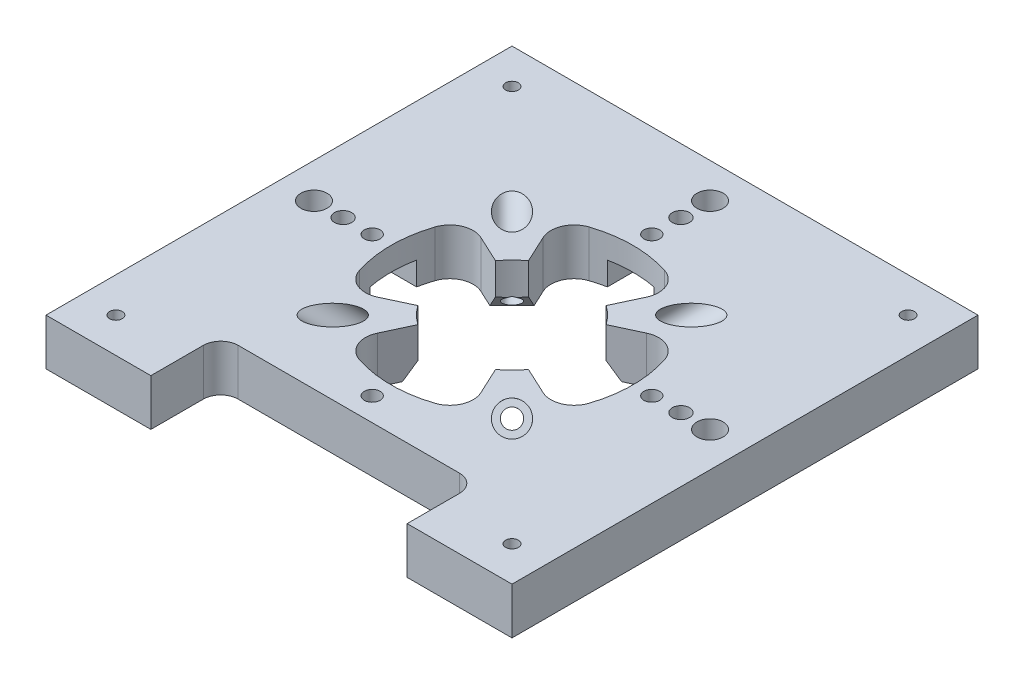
ISO-10303-21;
HEADER;
FILE_DESCRIPTION(('STEP AP214'),'2;1');
FILE_NAME('part.step','',(''),(''),'','','');
FILE_SCHEMA(('AUTOMOTIVE_DESIGN { 1 0 10303 214 1 1 1 1 }'));
ENDSEC;
DATA;
#1=APPLICATION_CONTEXT('core data for automotive mechanical design processes');
#2=APPLICATION_PROTOCOL_DEFINITION('international standard','automotive_design',2000,#1);
#3=PRODUCT_CONTEXT('',#1,'mechanical');
#4=PRODUCT('Part','Part','',(#3));
#5=PRODUCT_RELATED_PRODUCT_CATEGORY('part','',(#4));
#6=PRODUCT_DEFINITION_FORMATION('','',#4);
#7=PRODUCT_DEFINITION_CONTEXT('part definition',#1,'design');
#8=PRODUCT_DEFINITION('design','',#6,#7);
#9=PRODUCT_DEFINITION_SHAPE('','',#8);
#10=(LENGTH_UNIT() NAMED_UNIT(*) SI_UNIT(.MILLI.,.METRE.));
#11=(NAMED_UNIT(*) PLANE_ANGLE_UNIT() SI_UNIT($,.RADIAN.));
#12=(NAMED_UNIT(*) SI_UNIT($,.STERADIAN.) SOLID_ANGLE_UNIT());
#13=UNCERTAINTY_MEASURE_WITH_UNIT(LENGTH_MEASURE(1.E-05),#10,'distance_accuracy_value','');
#14=(GEOMETRIC_REPRESENTATION_CONTEXT(3) GLOBAL_UNCERTAINTY_ASSIGNED_CONTEXT((#13)) GLOBAL_UNIT_ASSIGNED_CONTEXT((#10,
#11,#12)) REPRESENTATION_CONTEXT('',''));
#15=CARTESIAN_POINT('',(0.,0.,0.));
#16=DIRECTION('',(0.,0.,1.));
#17=DIRECTION('',(1.,0.,0.));
#18=AXIS2_PLACEMENT_3D('',#15,#16,#17);
#19=CARTESIAN_POINT('',(53.975,0.,0.));
#20=DIRECTION('',(0.,-1.,0.));
#21=DIRECTION('',(0.,0.,-1.));
#22=AXIS2_PLACEMENT_3D('',#19,#20,#21);
#23=CYLINDRICAL_SURFACE('',#22,3.571875);
#24=CARTESIAN_POINT('',(53.975,12.7,0.));
#25=DIRECTION('',(0.,-1.,0.));
#26=DIRECTION('',(0.,0.,-1.));
#27=AXIS2_PLACEMENT_3D('',#24,#25,#26);
#28=CIRCLE('',#27,3.571875);
#29=CARTESIAN_POINT('',(53.975,12.7,-3.571875));
#30=VERTEX_POINT('',#29);
#31=EDGE_CURVE('E444',#30,#30,#28,.T.);
#32=ORIENTED_EDGE('',*,*,#31,.F.);
#33=EDGE_LOOP('',(#32));
#34=FACE_BOUND('',#33,.T.);
#35=CARTESIAN_POINT('',(53.975,6.35,0.));
#36=DIRECTION('',(0.,-1.,0.));
#37=DIRECTION('',(0.,0.,-1.));
#38=AXIS2_PLACEMENT_3D('',#35,#36,#37);
#39=CIRCLE('',#38,3.571875);
#40=CARTESIAN_POINT('',(53.975,6.35,-3.571875));
#41=VERTEX_POINT('',#40);
#42=EDGE_CURVE('E49',#41,#41,#39,.F.);
#43=ORIENTED_EDGE('',*,*,#42,.F.);
#44=EDGE_LOOP('',(#43));
#45=FACE_BOUND('',#44,.T.);
#46=ADVANCED_FACE('F45',(#34,#45),#23,.F.);
#47=CARTESIAN_POINT('',(0.,0.,0.));
#48=DIRECTION('',(0.,-1.,0.));
#49=DIRECTION('',(0.,0.,-1.));
#50=AXIS2_PLACEMENT_3D('',#47,#48,#49);
#51=PLANE('',#50);
#52=CARTESIAN_POINT('',(53.975,0.,0.));
#53=DIRECTION('',(0.,-1.,0.));
#54=DIRECTION('',(0.,0.,-1.));
#55=AXIS2_PLACEMENT_3D('',#52,#53,#54);
#56=CIRCLE('',#55,5.4864);
#57=CARTESIAN_POINT('',(53.975,0.,-5.4864));
#58=VERTEX_POINT('',#57);
#59=EDGE_CURVE('E1749',#58,#58,#56,.T.);
#60=ORIENTED_EDGE('',*,*,#59,.F.);
#61=EDGE_LOOP('',(#60));
#62=FACE_BOUND('',#61,.T.);
#63=DIRECTION('',(0.,0.,1.));
#64=VECTOR('',#63,1.);
#65=CARTESIAN_POINT('',(6.35,0.,-63.5));
#66=LINE('',#65,#64);
#67=CARTESIAN_POINT('',(6.35,0.,-63.5));
#68=VERTEX_POINT('',#67);
#69=CARTESIAN_POINT('',(6.35,0.,-32.3389609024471));
#70=VERTEX_POINT('',#69);
#71=EDGE_CURVE('E372',#68,#70,#66,.T.);
#72=ORIENTED_EDGE('',*,*,#71,.F.);
#73=DIRECTION('',(-1.,0.,0.));
#74=VECTOR('',#73,1.);
#75=CARTESIAN_POINT('',(-63.5,0.,-63.5));
#76=LINE('',#75,#74);
#77=CARTESIAN_POINT('',(63.5,0.,-63.5));
#78=VERTEX_POINT('',#77);
#79=EDGE_CURVE('E920',#78,#68,#76,.T.);
#80=ORIENTED_EDGE('',*,*,#79,.F.);
#81=DIRECTION('',(0.,0.,-1.));
#82=VECTOR('',#81,1.);
#83=CARTESIAN_POINT('',(63.5,0.,63.5));
#84=LINE('',#83,#82);
#85=CARTESIAN_POINT('',(63.5,0.,63.5));
#86=VERTEX_POINT('',#85);
#87=EDGE_CURVE('E898',#86,#78,#84,.T.);
#88=ORIENTED_EDGE('',*,*,#87,.F.);
#89=DIRECTION('',(1.,0.,0.));
#90=VECTOR('',#89,1.);
#91=CARTESIAN_POINT('',(-63.5,0.,63.5));
#92=LINE('',#91,#90);
#93=CARTESIAN_POINT('',(34.925,0.,63.5));
#94=VERTEX_POINT('',#93);
#95=EDGE_CURVE('E928',#94,#86,#92,.T.);
#96=ORIENTED_EDGE('',*,*,#95,.F.);
#97=DIRECTION('',(0.,0.,-1.));
#98=VECTOR('',#97,1.);
#99=CARTESIAN_POINT('',(34.925,0.,63.5));
#100=LINE('',#99,#98);
#101=CARTESIAN_POINT('',(34.925,0.,49.2125));
#102=VERTEX_POINT('',#101);
#103=EDGE_CURVE('E803',#94,#102,#100,.T.);
#104=ORIENTED_EDGE('',*,*,#103,.T.);
#105=CARTESIAN_POINT('',(30.1625,0.,49.2125));
#106=DIRECTION('',(0.,1.,0.));
#107=DIRECTION('',(0.,0.,1.));
#108=AXIS2_PLACEMENT_3D('',#105,#106,#107);
#109=CIRCLE('',#108,4.7625);
#110=CARTESIAN_POINT('',(30.1625,0.,44.45));
#111=VERTEX_POINT('',#110);
#112=EDGE_CURVE('E807',#102,#111,#109,.T.);
#113=ORIENTED_EDGE('',*,*,#112,.T.);
#114=DIRECTION('',(-1.,0.,0.));
#115=VECTOR('',#114,1.);
#116=CARTESIAN_POINT('',(30.1625,0.,44.45));
#117=LINE('',#116,#115);
#118=CARTESIAN_POINT('',(-30.1625,0.,44.45));
#119=VERTEX_POINT('',#118);
#120=EDGE_CURVE('E812',#111,#119,#117,.T.);
#121=ORIENTED_EDGE('',*,*,#120,.T.);
#122=CARTESIAN_POINT('',(-30.1625,0.,49.2125));
#123=DIRECTION('',(0.,1.,0.));
#124=DIRECTION('',(0.,0.,1.));
#125=AXIS2_PLACEMENT_3D('',#122,#123,#124);
#126=CIRCLE('',#125,4.7625);
#127=CARTESIAN_POINT('',(-34.925,0.,49.2125));
#128=VERTEX_POINT('',#127);
#129=EDGE_CURVE('E816',#119,#128,#126,.T.);
#130=ORIENTED_EDGE('',*,*,#129,.T.);
#131=DIRECTION('',(0.,0.,1.));
#132=VECTOR('',#131,1.);
#133=CARTESIAN_POINT('',(-34.925,0.,49.2125));
#134=LINE('',#133,#132);
#135=CARTESIAN_POINT('',(-34.925,0.,63.5));
#136=VERTEX_POINT('',#135);
#137=EDGE_CURVE('E820',#128,#136,#134,.T.);
#138=ORIENTED_EDGE('',*,*,#137,.T.);
#139=CARTESIAN_POINT('',(-63.5,0.,63.5));
#140=VERTEX_POINT('',#139);
#141=EDGE_CURVE('E904',#140,#136,#92,.T.);
#142=ORIENTED_EDGE('',*,*,#141,.F.);
#143=DIRECTION('',(0.,0.,1.));
#144=VECTOR('',#143,1.);
#145=CARTESIAN_POINT('',(-63.5,0.,63.5));
#146=LINE('',#145,#144);
#147=CARTESIAN_POINT('',(-63.5,0.,6.34999999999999));
#148=VERTEX_POINT('',#147);
#149=EDGE_CURVE('E923',#148,#140,#146,.T.);
#150=ORIENTED_EDGE('',*,*,#149,.F.);
#151=DIRECTION('',(-1.,0.,0.));
#152=VECTOR('',#151,1.);
#153=CARTESIAN_POINT('',(-63.5,0.,6.34999999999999));
#154=LINE('',#153,#152);
#155=CARTESIAN_POINT('',(-32.3389609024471,0.,6.34999999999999));
#156=VERTEX_POINT('',#155);
#157=EDGE_CURVE('E414',#156,#148,#154,.T.);
#158=ORIENTED_EDGE('',*,*,#157,.F.);
#159=CARTESIAN_POINT('',(0.,0.,0.));
#160=DIRECTION('',(0.,1.,0.));
#161=DIRECTION('',(0.,0.,1.));
#162=AXIS2_PLACEMENT_3D('',#159,#160,#161);
#163=CIRCLE('',#162,32.9565);
#164=CARTESIAN_POINT('',(-31.2996927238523,0.,10.3179517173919));
#165=VERTEX_POINT('',#164);
#166=EDGE_CURVE('E759',#156,#165,#163,.T.);
#167=ORIENTED_EDGE('',*,*,#166,.T.);
#168=CARTESIAN_POINT('',(-25.2689234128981,0.,8.32990707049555));
#169=DIRECTION('',(0.,1.,0.));
#170=DIRECTION('',(0.,0.,-1.));
#171=AXIS2_PLACEMENT_3D('',#168,#169,#170);
#172=CIRCLE('',#171,6.35);
#173=CARTESIAN_POINT('',(-22.5852974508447,0.,14.0849615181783));
#174=VERTEX_POINT('',#173);
#175=EDGE_CURVE('E764',#165,#174,#172,.T.);
#176=ORIENTED_EDGE('',*,*,#175,.T.);
#177=DIRECTION('',(0.906307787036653,0.,-0.422618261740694));
#178=VECTOR('',#177,1.);
#179=CARTESIAN_POINT('',(7.62,0.,0.));
#180=LINE('',#179,#178);
#181=CARTESIAN_POINT('',(-17.9414870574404,0.,11.9195171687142));
#182=VERTEX_POINT('',#181);
#183=EDGE_CURVE('E768',#174,#182,#180,.T.);
#184=ORIENTED_EDGE('',*,*,#183,.T.);
#185=DIRECTION('',(-0.707106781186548,0.,-0.707106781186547));
#186=VECTOR('',#185,1.);
#187=CARTESIAN_POINT('',(-11.3383996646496,0.,18.522604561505));
#188=LINE('',#187,#186);
#189=CARTESIAN_POINT('',(-11.9195171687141,0.,17.9414870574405));
#190=VERTEX_POINT('',#189);
#191=EDGE_CURVE('E501',#190,#182,#188,.T.);
#192=ORIENTED_EDGE('',*,*,#191,.F.);
#193=DIRECTION('',(-0.422618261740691,0.,0.906307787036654));
#194=VECTOR('',#193,1.);
#195=CARTESIAN_POINT('',(0.,0.,-7.62));
#196=LINE('',#195,#194);
#197=CARTESIAN_POINT('',(-14.0849615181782,0.,22.5852974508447));
#198=VERTEX_POINT('',#197);
#199=EDGE_CURVE('E700',#190,#198,#196,.T.);
#200=ORIENTED_EDGE('',*,*,#199,.T.);
#201=CARTESIAN_POINT('',(-8.32990707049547,0.,25.2689234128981));
#202=DIRECTION('',(0.,1.,0.));
#203=DIRECTION('',(1.,0.,0.));
#204=AXIS2_PLACEMENT_3D('',#201,#202,#203);
#205=CIRCLE('',#204,6.35);
#206=CARTESIAN_POINT('',(-10.3179517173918,0.,31.2996927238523));
#207=VERTEX_POINT('',#206);
#208=EDGE_CURVE('E703',#198,#207,#205,.T.);
#209=ORIENTED_EDGE('',*,*,#208,.T.);
#210=CARTESIAN_POINT('',(0.,0.,0.));
#211=DIRECTION('',(0.,1.,0.));
#212=DIRECTION('',(1.,0.,0.));
#213=AXIS2_PLACEMENT_3D('',#210,#211,#212);
#214=CIRCLE('',#213,32.9565);
#215=CARTESIAN_POINT('',(10.317951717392,0.,31.2996927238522));
#216=VERTEX_POINT('',#215);
#217=EDGE_CURVE('E708',#207,#216,#214,.T.);
#218=ORIENTED_EDGE('',*,*,#217,.T.);
#219=CARTESIAN_POINT('',(8.32990707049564,0.,25.2689234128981));
#220=DIRECTION('',(0.,1.,0.));
#221=DIRECTION('',(-1.,0.,0.));
#222=AXIS2_PLACEMENT_3D('',#219,#220,#221);
#223=CIRCLE('',#222,6.35);
#224=CARTESIAN_POINT('',(14.0849615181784,0.,22.5852974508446));
#225=VERTEX_POINT('',#224);
#226=EDGE_CURVE('E712',#216,#225,#223,.T.);
#227=ORIENTED_EDGE('',*,*,#226,.T.);
#228=DIRECTION('',(-0.422618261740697,0.,-0.906307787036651));
#229=VECTOR('',#228,1.);
#230=CARTESIAN_POINT('',(0.,0.,-7.62));
#231=LINE('',#230,#229);
#232=CARTESIAN_POINT('',(11.9195171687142,0.,17.9414870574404));
#233=VERTEX_POINT('',#232);
#234=EDGE_CURVE('E716',#225,#233,#231,.T.);
#235=ORIENTED_EDGE('',*,*,#234,.T.);
#236=DIRECTION('',(-0.70710678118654,0.,0.707106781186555));
#237=VECTOR('',#236,1.);
#238=CARTESIAN_POINT('',(18.5226045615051,0.,11.3383996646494));
#239=LINE('',#238,#237);
#240=CARTESIAN_POINT('',(17.9414870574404,0.,11.9195171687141));
#241=VERTEX_POINT('',#240);
#242=EDGE_CURVE('E496',#241,#233,#239,.T.);
#243=ORIENTED_EDGE('',*,*,#242,.F.);
#244=DIRECTION('',(0.906307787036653,0.,0.422618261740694));
#245=VECTOR('',#244,1.);
#246=CARTESIAN_POINT('',(-7.62,0.,0.));
#247=LINE('',#246,#245);
#248=CARTESIAN_POINT('',(22.5852974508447,0.,14.0849615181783));
#249=VERTEX_POINT('',#248);
#250=EDGE_CURVE('E649',#241,#249,#247,.T.);
#251=ORIENTED_EDGE('',*,*,#250,.T.);
#252=CARTESIAN_POINT('',(25.2689234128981,0.,8.32990707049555));
#253=DIRECTION('',(0.,1.,0.));
#254=DIRECTION('',(0.,0.,-1.));
#255=AXIS2_PLACEMENT_3D('',#252,#253,#254);
#256=CIRCLE('',#255,6.35);
#257=CARTESIAN_POINT('',(31.2996927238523,0.,10.3179517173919));
#258=VERTEX_POINT('',#257);
#259=EDGE_CURVE('E652',#249,#258,#256,.T.);
#260=ORIENTED_EDGE('',*,*,#259,.T.);
#261=CARTESIAN_POINT('',(0.,0.,0.));
#262=DIRECTION('',(0.,1.,0.));
#263=DIRECTION('',(0.,0.,-1.));
#264=AXIS2_PLACEMENT_3D('',#261,#262,#263);
#265=CIRCLE('',#264,32.9565);
#266=CARTESIAN_POINT('',(31.2996927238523,0.,-10.3179517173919));
#267=VERTEX_POINT('',#266);
#268=EDGE_CURVE('E657',#258,#267,#265,.T.);
#269=ORIENTED_EDGE('',*,*,#268,.T.);
#270=CARTESIAN_POINT('',(25.2689234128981,0.,-8.32990707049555));
#271=DIRECTION('',(0.,1.,0.));
#272=DIRECTION('',(0.,0.,1.));
#273=AXIS2_PLACEMENT_3D('',#270,#271,#272);
#274=CIRCLE('',#273,6.35);
#275=CARTESIAN_POINT('',(22.5852974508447,0.,-14.0849615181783));
#276=VERTEX_POINT('',#275);
#277=EDGE_CURVE('E661',#267,#276,#274,.T.);
#278=ORIENTED_EDGE('',*,*,#277,.T.);
#279=DIRECTION('',(-0.906307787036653,0.,0.422618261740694));
#280=VECTOR('',#279,1.);
#281=CARTESIAN_POINT('',(-7.62,0.,0.));
#282=LINE('',#281,#280);
#283=CARTESIAN_POINT('',(17.9414870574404,0.,-11.9195171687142));
#284=VERTEX_POINT('',#283);
#285=EDGE_CURVE('E665',#276,#284,#282,.T.);
#286=ORIENTED_EDGE('',*,*,#285,.T.);
#287=DIRECTION('',(0.707106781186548,0.,0.707106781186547));
#288=VECTOR('',#287,1.);
#289=CARTESIAN_POINT('',(11.3383996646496,0.,-18.522604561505));
#290=LINE('',#289,#288);
#291=CARTESIAN_POINT('',(11.919517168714,0.,-17.9414870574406));
#292=VERTEX_POINT('',#291);
#293=EDGE_CURVE('E544',#292,#284,#290,.T.);
#294=ORIENTED_EDGE('',*,*,#293,.F.);
#295=DIRECTION('',(0.422618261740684,0.,-0.906307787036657));
#296=VECTOR('',#295,1.);
#297=CARTESIAN_POINT('',(0.,0.,7.62));
#298=LINE('',#297,#296);
#299=CARTESIAN_POINT('',(14.0849615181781,0.,-22.5852974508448));
#300=VERTEX_POINT('',#299);
#301=EDGE_CURVE('E596',#292,#300,#298,.T.);
#302=ORIENTED_EDGE('',*,*,#301,.T.);
#303=CARTESIAN_POINT('',(8.32990707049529,0.,-25.2689234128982));
#304=DIRECTION('',(0.,1.,0.));
#305=DIRECTION('',(-1.,0.,0.));
#306=AXIS2_PLACEMENT_3D('',#303,#304,#305);
#307=CIRCLE('',#306,6.35);
#308=CARTESIAN_POINT('',(10.3179517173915,0.,-31.2996927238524));
#309=VERTEX_POINT('',#308);
#310=EDGE_CURVE('E599',#300,#309,#307,.T.);
#311=ORIENTED_EDGE('',*,*,#310,.T.);
#312=CARTESIAN_POINT('',(0.,0.,0.));
#313=DIRECTION('',(0.,1.,0.));
#314=DIRECTION('',(-1.,0.,0.));
#315=AXIS2_PLACEMENT_3D('',#312,#313,#314);
#316=CIRCLE('',#315,32.9565);
#317=EDGE_CURVE('E605',#309,#70,#316,.T.);
#318=ORIENTED_EDGE('',*,*,#317,.T.);
#319=EDGE_LOOP('',(#72,#80,#88,#96,#104,#113,#121,#130,#138,#142,#150,#158,#167,#176,#184,#192,
#200,#209,#218,#227,#235,#243,#251,#260,#269,#278,#286,#294,#302,#311,#318));
#320=FACE_BOUND('',#319,.T.);
#321=CARTESIAN_POINT('',(-53.975,0.,53.975));
#322=DIRECTION('',(0.,1.,0.));
#323=DIRECTION('',(0.,0.,1.));
#324=AXIS2_PLACEMENT_3D('',#321,#322,#323);
#325=CIRCLE('',#324,1.72719999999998);
#326=CARTESIAN_POINT('',(-53.975,0.,55.7022));
#327=VERTEX_POINT('',#326);
#328=EDGE_CURVE('E894',#327,#327,#325,.T.);
#329=ORIENTED_EDGE('',*,*,#328,.T.);
#330=EDGE_LOOP('',(#329));
#331=FACE_BOUND('',#330,.T.);
#332=CARTESIAN_POINT('',(53.975,0.,53.975));
#333=DIRECTION('',(0.,1.,0.));
#334=DIRECTION('',(0.,0.,1.));
#335=AXIS2_PLACEMENT_3D('',#332,#333,#334);
#336=CIRCLE('',#335,1.72719999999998);
#337=CARTESIAN_POINT('',(53.975,0.,55.7022));
#338=VERTEX_POINT('',#337);
#339=EDGE_CURVE('E886',#338,#338,#336,.T.);
#340=ORIENTED_EDGE('',*,*,#339,.T.);
#341=EDGE_LOOP('',(#340));
#342=FACE_BOUND('',#341,.T.);
#343=CARTESIAN_POINT('',(53.975,0.,-53.975));
#344=DIRECTION('',(0.,1.,0.));
#345=DIRECTION('',(0.,0.,1.));
#346=AXIS2_PLACEMENT_3D('',#343,#344,#345);
#347=CIRCLE('',#346,1.72719999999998);
#348=CARTESIAN_POINT('',(53.975,0.,-52.2478));
#349=VERTEX_POINT('',#348);
#350=EDGE_CURVE('E878',#349,#349,#347,.T.);
#351=ORIENTED_EDGE('',*,*,#350,.T.);
#352=EDGE_LOOP('',(#351));
#353=FACE_BOUND('',#352,.T.);
#354=CARTESIAN_POINT('',(0.,0.,38.1));
#355=DIRECTION('',(0.,1.,0.));
#356=DIRECTION('',(0.,0.,1.));
#357=AXIS2_PLACEMENT_3D('',#354,#355,#356);
#358=CIRCLE('',#357,2.15264999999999);
#359=CARTESIAN_POINT('',(0.,0.,40.25265));
#360=VERTEX_POINT('',#359);
#361=EDGE_CURVE('E492',#360,#360,#358,.T.);
#362=ORIENTED_EDGE('',*,*,#361,.T.);
#363=EDGE_LOOP('',(#362));
#364=FACE_BOUND('',#363,.T.);
#365=CARTESIAN_POINT('',(38.1,0.,0.));
#366=DIRECTION('',(0.,1.,0.));
#367=DIRECTION('',(0.,0.,1.));
#368=AXIS2_PLACEMENT_3D('',#365,#366,#367);
#369=CIRCLE('',#368,2.15264999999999);
#370=CARTESIAN_POINT('',(38.1,0.,2.15264999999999));
#371=VERTEX_POINT('',#370);
#372=EDGE_CURVE('E480',#371,#371,#369,.T.);
#373=ORIENTED_EDGE('',*,*,#372,.T.);
#374=EDGE_LOOP('',(#373));
#375=FACE_BOUND('',#374,.T.);
#376=CARTESIAN_POINT('',(46.0375,0.,0.));
#377=DIRECTION('',(0.,1.,0.));
#378=DIRECTION('',(0.,0.,1.));
#379=AXIS2_PLACEMENT_3D('',#376,#377,#378);
#380=CIRCLE('',#379,2.34949999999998);
#381=CARTESIAN_POINT('',(46.0375,0.,2.34949999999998));
#382=VERTEX_POINT('',#381);
#383=EDGE_CURVE('E464',#382,#382,#380,.T.);
#384=ORIENTED_EDGE('',*,*,#383,.T.);
#385=EDGE_LOOP('',(#384));
#386=FACE_BOUND('',#385,.T.);
#387=ADVANCED_FACE('F1101',(#62,#320,#331,#342,#353,#364,#375,#386),#51,.T.);
#388=CARTESIAN_POINT('',(0.,12.7,-38.1));
#389=DIRECTION('',(0.,1.,0.));
#390=DIRECTION('',(0.,0.,1.));
#391=AXIS2_PLACEMENT_3D('',#388,#389,#390);
#392=CYLINDRICAL_SURFACE('',#391,2.15264999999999);
#393=CARTESIAN_POINT('',(0.,12.7,-38.1));
#394=DIRECTION('',(0.,1.,0.));
#395=DIRECTION('',(0.,0.,1.));
#396=AXIS2_PLACEMENT_3D('',#393,#394,#395);
#397=CIRCLE('',#396,2.15264999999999);
#398=CARTESIAN_POINT('',(0.,12.7,-35.94735));
#399=VERTEX_POINT('',#398);
#400=EDGE_CURVE('E484',#399,#399,#397,.T.);
#401=ORIENTED_EDGE('',*,*,#400,.T.);
#402=EDGE_LOOP('',(#401));
#403=FACE_BOUND('',#402,.T.);
#404=CARTESIAN_POINT('',(0.,6.35,-38.1));
#405=DIRECTION('',(0.,-1.,0.));
#406=DIRECTION('',(0.,0.,-1.));
#407=AXIS2_PLACEMENT_3D('',#404,#405,#406);
#408=CIRCLE('',#407,2.15264999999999);
#409=CARTESIAN_POINT('',(0.,6.35,-40.25265));
#410=VERTEX_POINT('',#409);
#411=EDGE_CURVE('E404',#410,#410,#408,.F.);
#412=ORIENTED_EDGE('',*,*,#411,.F.);
#413=EDGE_LOOP('',(#412));
#414=FACE_BOUND('',#413,.T.);
#415=ADVANCED_FACE('F1107',(#403,#414),#392,.F.);
#416=CARTESIAN_POINT('',(0.,12.7,-46.0375));
#417=DIRECTION('',(0.,1.,0.));
#418=DIRECTION('',(0.,0.,1.));
#419=AXIS2_PLACEMENT_3D('',#416,#417,#418);
#420=CYLINDRICAL_SURFACE('',#419,2.34949999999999);
#421=CARTESIAN_POINT('',(0.,12.7,-46.0375));
#422=DIRECTION('',(0.,1.,0.));
#423=DIRECTION('',(0.,0.,1.));
#424=AXIS2_PLACEMENT_3D('',#421,#422,#423);
#425=CIRCLE('',#424,2.34949999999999);
#426=CARTESIAN_POINT('',(0.,12.7,-43.688));
#427=VERTEX_POINT('',#426);
#428=EDGE_CURVE('E468',#427,#427,#425,.T.);
#429=ORIENTED_EDGE('',*,*,#428,.T.);
#430=EDGE_LOOP('',(#429));
#431=FACE_BOUND('',#430,.T.);
#432=CARTESIAN_POINT('',(0.,6.35,-46.0375));
#433=DIRECTION('',(0.,-1.,0.));
#434=DIRECTION('',(0.,0.,-1.));
#435=AXIS2_PLACEMENT_3D('',#432,#433,#434);
#436=CIRCLE('',#435,2.34949999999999);
#437=CARTESIAN_POINT('',(0.,6.35,-48.387));
#438=VERTEX_POINT('',#437);
#439=EDGE_CURVE('E400',#438,#438,#436,.F.);
#440=ORIENTED_EDGE('',*,*,#439,.F.);
#441=EDGE_LOOP('',(#440));
#442=FACE_BOUND('',#441,.T.);
#443=ADVANCED_FACE('F1127',(#431,#442),#420,.F.);
#444=CARTESIAN_POINT('',(0.,0.,-53.975));
#445=DIRECTION('',(0.,-1.,0.));
#446=DIRECTION('',(0.,0.,-1.));
#447=AXIS2_PLACEMENT_3D('',#444,#445,#446);
#448=CYLINDRICAL_SURFACE('',#447,3.571875);
#449=CARTESIAN_POINT('',(0.,12.7,-53.975));
#450=DIRECTION('',(0.,-1.,0.));
#451=DIRECTION('',(0.,0.,-1.));
#452=AXIS2_PLACEMENT_3D('',#449,#450,#451);
#453=CIRCLE('',#452,3.571875);
#454=CARTESIAN_POINT('',(0.,12.7,-57.546875));
#455=VERTEX_POINT('',#454);
#456=EDGE_CURVE('E452',#455,#455,#453,.T.);
#457=ORIENTED_EDGE('',*,*,#456,.F.);
#458=EDGE_LOOP('',(#457));
#459=FACE_BOUND('',#458,.T.);
#460=CARTESIAN_POINT('',(0.,6.35,-53.975));
#461=DIRECTION('',(0.,-1.,0.));
#462=DIRECTION('',(0.,0.,-1.));
#463=AXIS2_PLACEMENT_3D('',#460,#461,#462);
#464=CIRCLE('',#463,3.571875);
#465=CARTESIAN_POINT('',(0.,6.35,-57.546875));
#466=VERTEX_POINT('',#465);
#467=EDGE_CURVE('E398',#466,#466,#464,.F.);
#468=ORIENTED_EDGE('',*,*,#467,.F.);
#469=EDGE_LOOP('',(#468));
#470=FACE_BOUND('',#469,.T.);
#471=ADVANCED_FACE('F1123',(#459,#470),#448,.F.);
#472=CARTESIAN_POINT('',(0.,0.,0.));
#473=DIRECTION('',(0.,1.,0.));
#474=DIRECTION('',(0.,0.,1.));
#475=AXIS2_PLACEMENT_3D('',#472,#473,#474);
#476=CYLINDRICAL_SURFACE('',#475,18.415);
#477=DIRECTION('',(0.,1.,0.));
#478=VECTOR('',#477,1.);
#479=CARTESIAN_POINT('',(-10.5812189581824,0.,15.0714972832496));
#480=LINE('',#479,#478);
#481=CARTESIAN_POINT('',(-10.5812189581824,12.7,15.0714972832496));
#482=VERTEX_POINT('',#481);
#483=CARTESIAN_POINT('',(-10.5812189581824,4.20274449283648,15.0714972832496));
#484=VERTEX_POINT('',#483);
#485=EDGE_CURVE('E971',#482,#484,#480,.F.);
#486=ORIENTED_EDGE('',*,*,#485,.T.);
#487=CARTESIAN_POINT('',(0.,29.8216689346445,0.));
#488=DIRECTION('',(-0.577096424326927,0.577857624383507,0.577096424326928));
#489=DIRECTION('',(0.408607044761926,0.816137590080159,-0.408607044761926));
#490=AXIS2_PLACEMENT_3D('',#487,#488,#489);
#491=ELLIPSE('',#490,31.8677113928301,18.415);
#492=CARTESIAN_POINT('',(-12.4404458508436,3.83803182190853,13.5774641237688));
#493=VERTEX_POINT('',#492);
#494=EDGE_CURVE('E522',#484,#493,#491,.F.);
#495=ORIENTED_EDGE('',*,*,#494,.T.);
#496=CARTESIAN_POINT('',(-11.5116262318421,0.,14.3734020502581));
#497=CARTESIAN_POINT('',(-11.4831217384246,0.0891143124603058,14.3962238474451));
#498=CARTESIAN_POINT('',(-11.4581183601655,0.179992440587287,14.4161182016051));
#499=CARTESIAN_POINT('',(-11.4150516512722,0.36433567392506,14.4502461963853));
#500=CARTESIAN_POINT('',(-11.3969821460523,0.457798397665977,14.4644848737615));
#501=CARTESIAN_POINT('',(-11.3531863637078,0.739792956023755,14.4989259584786));
#502=CARTESIAN_POINT('',(-11.3375413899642,0.930995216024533,14.5111154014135));
#503=CARTESIAN_POINT('',(-11.3324885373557,1.29572362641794,14.5150565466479));
#504=CARTESIAN_POINT('',(-11.3407561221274,1.46922461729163,14.5086189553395));
#505=CARTESIAN_POINT('',(-11.3777923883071,1.81303419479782,14.4795933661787));
#506=CARTESIAN_POINT('',(-11.4066022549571,1.98333566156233,14.4569729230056));
#507=CARTESIAN_POINT('',(-11.4881403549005,2.33364529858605,14.392285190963));
#508=CARTESIAN_POINT('',(-11.5430379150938,2.51283039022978,14.3484455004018));
#509=CARTESIAN_POINT('',(-11.6764227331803,2.85546953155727,14.2401107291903));
#510=CARTESIAN_POINT('',(-11.7548667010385,3.01895172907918,14.1756535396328));
#511=CARTESIAN_POINT('',(-11.9058626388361,3.27343405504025,14.04880790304));
#512=CARTESIAN_POINT('',(-11.9723691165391,3.37096110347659,13.9922678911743));
#513=CARTESIAN_POINT('',(-12.1153259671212,3.55090380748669,13.8686697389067));
#514=CARTESIAN_POINT('',(-12.1917607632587,3.63334265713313,13.8016280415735));
#515=CARTESIAN_POINT('',(-12.3389127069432,3.76567028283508,13.6700907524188));
#516=CARTESIAN_POINT('',(-12.4082404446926,3.81873875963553,13.6072516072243));
#517=CARTESIAN_POINT('',(-12.551367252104,3.90875259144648,13.4753421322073));
#518=CARTESIAN_POINT('',(-12.625163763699,3.94570707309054,13.4062753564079));
#519=CARTESIAN_POINT('',(-12.7756434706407,4.00114758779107,13.2629558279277));
#520=CARTESIAN_POINT('',(-12.8523412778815,4.01952196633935,13.1886745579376));
#521=CARTESIAN_POINT('',(-13.0055005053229,4.03588906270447,13.0376656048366));
#522=CARTESIAN_POINT('',(-13.0819620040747,4.03388949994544,12.9609388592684));
#523=CARTESIAN_POINT('',(-13.2243848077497,4.01093536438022,12.8155062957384));
#524=CARTESIAN_POINT('',(-13.290631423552,3.99189666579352,12.7467657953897));
#525=CARTESIAN_POINT('',(-13.4191082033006,3.93874990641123,12.611442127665));
#526=CARTESIAN_POINT('',(-13.4813379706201,3.90464036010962,12.544859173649));
#527=CARTESIAN_POINT('',(-13.6032076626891,3.82151985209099,12.412630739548));
#528=CARTESIAN_POINT('',(-13.6626282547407,3.77194199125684,12.3471427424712));
#529=CARTESIAN_POINT('',(-13.7753352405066,3.66081950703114,12.2212731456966));
#530=CARTESIAN_POINT('',(-13.8286172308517,3.59926637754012,12.1608952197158));
#531=CARTESIAN_POINT('',(-13.9519505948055,3.43577945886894,12.0194728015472));
#532=CARTESIAN_POINT('',(-14.0184333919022,3.32829925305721,11.9417063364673));
#533=CARTESIAN_POINT('',(-14.1382385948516,3.0982013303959,11.7996230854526));
#534=CARTESIAN_POINT('',(-14.1915400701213,2.97555999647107,11.7353277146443));
#535=CARTESIAN_POINT('',(-14.2863026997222,2.71751335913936,11.6197867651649));
#536=CARTESIAN_POINT('',(-14.3275674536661,2.58193963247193,11.5687589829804));
#537=CARTESIAN_POINT('',(-14.3976904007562,2.30313398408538,11.4813703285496));
#538=CARTESIAN_POINT('',(-14.4265463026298,2.15990065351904,11.4450121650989));
#539=CARTESIAN_POINT('',(-14.4769913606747,1.83760109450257,11.3811676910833));
#540=CARTESIAN_POINT('',(-14.4957408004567,1.65737866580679,11.3571991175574));
#541=CARTESIAN_POINT('',(-14.5153228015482,1.29447986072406,11.3321615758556));
#542=CARTESIAN_POINT('',(-14.5161645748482,1.11180479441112,11.3310808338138));
#543=CARTESIAN_POINT('',(-14.5002309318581,0.77097366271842,11.3514608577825));
#544=CARTESIAN_POINT('',(-14.4856080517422,0.612563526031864,11.3701674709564));
#545=CARTESIAN_POINT('',(-14.4523034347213,0.379097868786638,11.4124253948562));
#546=CARTESIAN_POINT('',(-14.4392868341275,0.301887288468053,11.4289029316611));
#547=CARTESIAN_POINT('',(-14.4093237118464,0.149371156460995,11.4666549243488));
#548=CARTESIAN_POINT('',(-14.3923744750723,0.0740669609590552,11.4879326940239));
#549=CARTESIAN_POINT('',(-14.3734020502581,0.,11.5116262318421));
#550=B_SPLINE_CURVE_WITH_KNOTS('',3,(#496,#497,#498,#499,#500,#501,#502,#503,#504,#505,#506,
#507,#508,#509,#510,#511,#512,#513,#514,#515,#516,#517,#518,#519,#520,#521,#522,#523,#524,#525,
#526,#527,#528,#529,#530,#531,#532,#533,#534,#535,#536,#537,#538,#539,#540,#541,#542,#543,#544,
#545,#546,#547,#548,#549),.UNSPECIFIED.,.F.,.F.,(4,2,2,2,2,2,2,2,2,2,2,2,2,2,2,2,2,2,2,2,2,2,2,
2,2,2,4),(0.,0.288622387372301,0.576987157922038,1.15033603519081,1.6698765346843,
2.19046160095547,2.76499666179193,3.33848184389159,3.72977375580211,4.12045901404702,
4.44186848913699,4.76309568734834,5.08624198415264,5.40926584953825,5.69998102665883,
5.99072486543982,6.29370915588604,6.59690944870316,7.03965728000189,7.48310369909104,
7.93342582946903,8.38383107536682,8.92977457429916,9.47543722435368,9.9540348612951,
10.1938467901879,10.433824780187),.UNSPECIFIED.);
#551=CARTESIAN_POINT('',(-13.5774641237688,3.83803182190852,12.4404458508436));
#552=VERTEX_POINT('',#551);
#553=EDGE_CURVE('E1197',#493,#552,#550,.T.);
#554=ORIENTED_EDGE('',*,*,#553,.T.);
#555=CARTESIAN_POINT('',(-15.0714972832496,4.20274449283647,10.5812189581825));
#556=VERTEX_POINT('',#555);
#557=EDGE_CURVE('E518',#552,#556,#491,.F.);
#558=ORIENTED_EDGE('',*,*,#557,.T.);
#559=DIRECTION('',(0.,1.,0.));
#560=VECTOR('',#559,1.);
#561=CARTESIAN_POINT('',(-15.0714972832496,0.,10.5812189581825));
#562=LINE('',#561,#560);
#563=CARTESIAN_POINT('',(-15.0714972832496,12.7,10.5812189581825));
#564=VERTEX_POINT('',#563);
#565=EDGE_CURVE('E947',#556,#564,#562,.T.);
#566=ORIENTED_EDGE('',*,*,#565,.T.);
#567=CARTESIAN_POINT('',(0.,12.7,0.));
#568=DIRECTION('',(0.,1.,0.));
#569=DIRECTION('',(0.,0.,1.));
#570=AXIS2_PLACEMENT_3D('',#567,#568,#569);
#571=CIRCLE('',#570,18.415);
#572=EDGE_CURVE('E861',#564,#482,#571,.T.);
#573=ORIENTED_EDGE('',*,*,#572,.T.);
#574=EDGE_LOOP('',(#486,#495,#554,#558,#566,#573));
#575=FACE_BOUND('',#574,.T.);
#576=ADVANCED_FACE('F1126',(#575),#476,.F.);
#577=DIRECTION('',(0.,1.,0.));
#578=VECTOR('',#577,1.);
#579=CARTESIAN_POINT('',(15.0714972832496,0.,10.5812189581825));
#580=LINE('',#579,#578);
#581=CARTESIAN_POINT('',(15.0714972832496,12.7,10.5812189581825));
#582=VERTEX_POINT('',#581);
#583=CARTESIAN_POINT('',(15.0714972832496,4.20274449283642,10.5812189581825));
#584=VERTEX_POINT('',#583);
#585=EDGE_CURVE('E964',#582,#584,#580,.F.);
#586=ORIENTED_EDGE('',*,*,#585,.T.);
#587=CARTESIAN_POINT('',(0.,29.8216689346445,0.));
#588=DIRECTION('',(0.577096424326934,0.577857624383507,0.577096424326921));
#589=DIRECTION('',(-0.408607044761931,0.81613759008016,-0.408607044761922));
#590=AXIS2_PLACEMENT_3D('',#587,#588,#589);
#591=ELLIPSE('',#590,31.8677113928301,18.415);
#592=CARTESIAN_POINT('',(13.5774641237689,3.83803182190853,12.4404458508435));
#593=VERTEX_POINT('',#592);
#594=EDGE_CURVE('E509',#584,#593,#591,.F.);
#595=ORIENTED_EDGE('',*,*,#594,.T.);
#596=CARTESIAN_POINT('',(14.3734020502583,0.,11.5116262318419));
#597=CARTESIAN_POINT('',(14.3962238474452,0.0891143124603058,11.4831217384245));
#598=CARTESIAN_POINT('',(14.4161182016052,0.179992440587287,11.4581183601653));
#599=CARTESIAN_POINT('',(14.4502461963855,0.36433567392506,11.415051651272));
#600=CARTESIAN_POINT('',(14.4644848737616,0.457798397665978,11.3969821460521));
#601=CARTESIAN_POINT('',(14.4989259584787,0.739792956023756,11.3531863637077));
#602=CARTESIAN_POINT('',(14.5111154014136,0.930995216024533,11.337541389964));
#603=CARTESIAN_POINT('',(14.5150565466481,1.29572362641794,11.3324885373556));
#604=CARTESIAN_POINT('',(14.5086189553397,1.46922461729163,11.3407561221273));
#605=CARTESIAN_POINT('',(14.4795933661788,1.81303419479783,11.377792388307));
#606=CARTESIAN_POINT('',(14.4569729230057,1.98333566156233,11.4066022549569));
#607=CARTESIAN_POINT('',(14.3922851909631,2.33364529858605,11.4881403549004));
#608=CARTESIAN_POINT('',(14.3484455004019,2.51283039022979,11.5430379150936));
#609=CARTESIAN_POINT('',(14.2401107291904,2.85546953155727,11.6764227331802));
#610=CARTESIAN_POINT('',(14.175653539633,3.01895172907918,11.7548667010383));
#611=CARTESIAN_POINT('',(14.0488079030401,3.27343405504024,11.9058626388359));
#612=CARTESIAN_POINT('',(13.9922678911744,3.37096110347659,11.972369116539));
#613=CARTESIAN_POINT('',(13.8686697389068,3.55090380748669,12.115325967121));
#614=CARTESIAN_POINT('',(13.8016280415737,3.63334265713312,12.1917607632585));
#615=CARTESIAN_POINT('',(13.6700907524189,3.76567028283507,12.3389127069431));
#616=CARTESIAN_POINT('',(13.6072516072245,3.81873875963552,12.4082404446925));
#617=CARTESIAN_POINT('',(13.4753421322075,3.90875259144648,12.5513672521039));
#618=CARTESIAN_POINT('',(13.4062753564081,3.94570707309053,12.6251637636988));
#619=CARTESIAN_POINT('',(13.2629558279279,4.00114758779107,12.7756434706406));
#620=CARTESIAN_POINT('',(13.1886745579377,4.01952196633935,12.8523412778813));
#621=CARTESIAN_POINT('',(13.0376656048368,4.03588906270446,13.0055005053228));
#622=CARTESIAN_POINT('',(12.9609388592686,4.03388949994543,13.0819620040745));
#623=CARTESIAN_POINT('',(12.8155062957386,4.01093536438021,13.2243848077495));
#624=CARTESIAN_POINT('',(12.7467657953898,3.99189666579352,13.2906314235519));
#625=CARTESIAN_POINT('',(12.6114421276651,3.93874990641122,13.4191082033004));
#626=CARTESIAN_POINT('',(12.5448591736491,3.90464036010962,13.4813379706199));
#627=CARTESIAN_POINT('',(12.4126307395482,3.82151985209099,13.603207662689));
#628=CARTESIAN_POINT('',(12.3471427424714,3.77194199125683,13.6626282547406));
#629=CARTESIAN_POINT('',(12.2212731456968,3.66081950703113,13.7753352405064));
#630=CARTESIAN_POINT('',(12.1608952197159,3.59926637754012,13.8286172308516));
#631=CARTESIAN_POINT('',(12.0194728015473,3.43577945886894,13.9519505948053));
#632=CARTESIAN_POINT('',(11.9417063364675,3.32829925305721,14.018433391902));
#633=CARTESIAN_POINT('',(11.7996230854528,3.0982013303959,14.1382385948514));
#634=CARTESIAN_POINT('',(11.7353277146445,2.97555999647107,14.1915400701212));
#635=CARTESIAN_POINT('',(11.619786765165,2.71751335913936,14.2863026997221));
#636=CARTESIAN_POINT('',(11.5687589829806,2.58193963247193,14.3275674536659));
#637=CARTESIAN_POINT('',(11.4813703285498,2.3031339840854,14.397690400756));
#638=CARTESIAN_POINT('',(11.4450121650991,2.15990065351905,14.4265463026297));
#639=CARTESIAN_POINT('',(11.3811676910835,1.83760109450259,14.4769913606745));
#640=CARTESIAN_POINT('',(11.3571991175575,1.65737866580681,14.4957408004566));
#641=CARTESIAN_POINT('',(11.3321615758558,1.29447986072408,14.5153228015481));
#642=CARTESIAN_POINT('',(11.331080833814,1.11180479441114,14.516164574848));
#643=CARTESIAN_POINT('',(11.3514608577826,0.770973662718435,14.500230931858));
#644=CARTESIAN_POINT('',(11.3701674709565,0.612563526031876,14.4856080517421));
#645=CARTESIAN_POINT('',(11.4124253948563,0.379097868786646,14.4523034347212));
#646=CARTESIAN_POINT('',(11.4289029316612,0.30188728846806,14.4392868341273));
#647=CARTESIAN_POINT('',(11.4666549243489,0.149371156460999,14.4093237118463));
#648=CARTESIAN_POINT('',(11.487932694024,0.074066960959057,14.3923744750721));
#649=CARTESIAN_POINT('',(11.5116262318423,0.,14.373402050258));
#650=B_SPLINE_CURVE_WITH_KNOTS('',3,(#596,#597,#598,#599,#600,#601,#602,#603,#604,#605,#606,
#607,#608,#609,#610,#611,#612,#613,#614,#615,#616,#617,#618,#619,#620,#621,#622,#623,#624,#625,
#626,#627,#628,#629,#630,#631,#632,#633,#634,#635,#636,#637,#638,#639,#640,#641,#642,#643,#644,
#645,#646,#647,#648,#649),.UNSPECIFIED.,.F.,.F.,(4,2,2,2,2,2,2,2,2,2,2,2,2,2,2,2,2,2,2,2,2,2,2,
2,2,2,4),(0.,0.288622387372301,0.576987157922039,1.15033603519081,1.6698765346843,
2.19046160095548,2.76499666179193,3.33848184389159,3.72977375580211,4.12045901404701,
4.44186848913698,4.76309568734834,5.08624198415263,5.40926584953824,5.69998102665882,
5.99072486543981,6.29370915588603,6.59690944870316,7.03965728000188,7.48310369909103,
7.93342582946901,8.3838310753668,8.92977457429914,9.47543722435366,9.95403486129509,
10.1938467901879,10.433824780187),.UNSPECIFIED.);
#651=CARTESIAN_POINT('',(12.4404458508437,3.83803182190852,13.5774641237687));
#652=VERTEX_POINT('',#651);
#653=EDGE_CURVE('E1187',#593,#652,#650,.T.);
#654=ORIENTED_EDGE('',*,*,#653,.T.);
#655=CARTESIAN_POINT('',(10.5812189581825,4.2027444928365,15.0714972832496));
#656=VERTEX_POINT('',#655);
#657=EDGE_CURVE('E500',#652,#656,#591,.F.);
#658=ORIENTED_EDGE('',*,*,#657,.T.);
#659=DIRECTION('',(0.,1.,0.));
#660=VECTOR('',#659,1.);
#661=CARTESIAN_POINT('',(10.5812189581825,0.,15.0714972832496));
#662=LINE('',#661,#660);
#663=CARTESIAN_POINT('',(10.5812189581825,12.7,15.0714972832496));
#664=VERTEX_POINT('',#663);
#665=EDGE_CURVE('E968',#656,#664,#662,.T.);
#666=ORIENTED_EDGE('',*,*,#665,.T.);
#667=EDGE_CURVE('E866',#664,#582,#571,.T.);
#668=ORIENTED_EDGE('',*,*,#667,.T.);
#669=EDGE_LOOP('',(#586,#595,#654,#658,#666,#668));
#670=FACE_BOUND('',#669,.T.);
#671=ADVANCED_FACE('F1266',(#670),#476,.F.);
#672=DIRECTION('',(0.,1.,0.));
#673=VECTOR('',#672,1.);
#674=CARTESIAN_POINT('',(-15.0714972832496,0.,-10.5812189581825));
#675=LINE('',#674,#673);
#676=CARTESIAN_POINT('',(-15.0714972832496,12.7,-10.5812189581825));
#677=VERTEX_POINT('',#676);
#678=CARTESIAN_POINT('',(-15.0714972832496,4.20274449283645,-10.5812189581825));
#679=VERTEX_POINT('',#678);
#680=EDGE_CURVE('E950',#677,#679,#675,.F.);
#681=ORIENTED_EDGE('',*,*,#680,.T.);
#682=CARTESIAN_POINT('',(0.,29.8216689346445,0.));
#683=DIRECTION('',(-0.57709642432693,0.577857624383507,-0.577096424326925));
#684=DIRECTION('',(0.408607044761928,0.816137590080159,0.408607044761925));
#685=AXIS2_PLACEMENT_3D('',#682,#683,#684);
#686=ELLIPSE('',#685,31.8677113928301,18.415);
#687=CARTESIAN_POINT('',(-13.5774641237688,3.83803182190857,-12.4404458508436));
#688=VERTEX_POINT('',#687);
#689=EDGE_CURVE('E535',#679,#688,#686,.F.);
#690=ORIENTED_EDGE('',*,*,#689,.T.);
#691=CARTESIAN_POINT('',(-14.3734020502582,0.,-11.511626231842));
#692=CARTESIAN_POINT('',(-14.3962238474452,0.0891143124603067,-11.4831217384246));
#693=CARTESIAN_POINT('',(-14.4161182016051,0.179992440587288,-11.4581183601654));
#694=CARTESIAN_POINT('',(-14.4502461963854,0.364335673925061,-11.4150516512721));
#695=CARTESIAN_POINT('',(-14.4644848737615,0.457798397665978,-11.3969821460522));
#696=CARTESIAN_POINT('',(-14.4989259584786,0.739792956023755,-11.3531863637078));
#697=CARTESIAN_POINT('',(-14.5111154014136,0.930995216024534,-11.3375413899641));
#698=CARTESIAN_POINT('',(-14.515056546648,1.29572362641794,-11.3324885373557));
#699=CARTESIAN_POINT('',(-14.5086189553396,1.46922461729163,-11.3407561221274));
#700=CARTESIAN_POINT('',(-14.4795933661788,1.81303419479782,-11.3777923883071));
#701=CARTESIAN_POINT('',(-14.4569729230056,1.98333566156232,-11.406602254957));
#702=CARTESIAN_POINT('',(-14.392285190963,2.33364529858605,-11.4881403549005));
#703=CARTESIAN_POINT('',(-14.3484455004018,2.51283039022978,-11.5430379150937));
#704=CARTESIAN_POINT('',(-14.2401107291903,2.85546953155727,-11.6764227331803));
#705=CARTESIAN_POINT('',(-14.1756535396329,3.01895172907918,-11.7548667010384));
#706=CARTESIAN_POINT('',(-14.04880790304,3.27343405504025,-11.905862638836));
#707=CARTESIAN_POINT('',(-13.9922678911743,3.37096110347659,-11.9723691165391));
#708=CARTESIAN_POINT('',(-13.8686697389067,3.55090380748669,-12.1153259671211));
#709=CARTESIAN_POINT('',(-13.8016280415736,3.63334265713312,-12.1917607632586));
#710=CARTESIAN_POINT('',(-13.6700907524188,3.76567028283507,-12.3389127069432));
#711=CARTESIAN_POINT('',(-13.6072516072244,3.81873875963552,-12.4082404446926));
#712=CARTESIAN_POINT('',(-13.4753421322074,3.90875259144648,-12.551367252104));
#713=CARTESIAN_POINT('',(-13.406275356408,3.94570707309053,-12.6251637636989));
#714=CARTESIAN_POINT('',(-13.2629558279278,4.00114758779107,-12.7756434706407));
#715=CARTESIAN_POINT('',(-13.1886745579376,4.01952196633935,-12.8523412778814));
#716=CARTESIAN_POINT('',(-13.0376656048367,4.03588906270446,-13.0055005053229));
#717=CARTESIAN_POINT('',(-12.9609388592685,4.03388949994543,-13.0819620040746));
#718=CARTESIAN_POINT('',(-12.8155062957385,4.01093536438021,-13.2243848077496));
#719=CARTESIAN_POINT('',(-12.7467657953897,3.99189666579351,-13.290631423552));
#720=CARTESIAN_POINT('',(-12.611442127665,3.93874990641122,-13.4191082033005));
#721=CARTESIAN_POINT('',(-12.544859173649,3.90464036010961,-13.48133797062));
#722=CARTESIAN_POINT('',(-12.4126307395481,3.82151985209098,-13.6032076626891));
#723=CARTESIAN_POINT('',(-12.3471427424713,3.77194199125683,-13.6626282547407));
#724=CARTESIAN_POINT('',(-12.2212731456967,3.66081950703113,-13.7753352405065));
#725=CARTESIAN_POINT('',(-12.1608952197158,3.59926637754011,-13.8286172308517));
#726=CARTESIAN_POINT('',(-12.0194728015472,3.43577945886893,-13.9519505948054));
#727=CARTESIAN_POINT('',(-11.9417063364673,3.3282992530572,-14.0184333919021));
#728=CARTESIAN_POINT('',(-11.7996230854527,3.09820133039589,-14.1382385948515));
#729=CARTESIAN_POINT('',(-11.7353277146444,2.97555999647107,-14.1915400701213));
#730=CARTESIAN_POINT('',(-11.6197867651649,2.71751335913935,-14.2863026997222));
#731=CARTESIAN_POINT('',(-11.5687589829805,2.58193963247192,-14.327567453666));
#732=CARTESIAN_POINT('',(-11.4813703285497,2.30313398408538,-14.3976904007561));
#733=CARTESIAN_POINT('',(-11.445012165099,2.15990065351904,-14.4265463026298));
#734=CARTESIAN_POINT('',(-11.3811676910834,1.83760109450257,-14.4769913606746));
#735=CARTESIAN_POINT('',(-11.3571991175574,1.65737866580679,-14.4957408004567));
#736=CARTESIAN_POINT('',(-11.3321615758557,1.29447986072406,-14.5153228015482));
#737=CARTESIAN_POINT('',(-11.3310808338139,1.11180479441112,-14.5161645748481));
#738=CARTESIAN_POINT('',(-11.3514608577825,0.770973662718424,-14.500230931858));
#739=CARTESIAN_POINT('',(-11.3701674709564,0.612563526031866,-14.4856080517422));
#740=CARTESIAN_POINT('',(-11.4124253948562,0.37909786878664,-14.4523034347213));
#741=CARTESIAN_POINT('',(-11.4289029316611,0.301887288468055,-14.4392868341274));
#742=CARTESIAN_POINT('',(-11.4666549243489,0.149371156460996,-14.4093237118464));
#743=CARTESIAN_POINT('',(-11.487932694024,0.0740669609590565,-14.3923744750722));
#744=CARTESIAN_POINT('',(-11.5116262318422,0.,-14.3734020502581));
#745=B_SPLINE_CURVE_WITH_KNOTS('',3,(#691,#692,#693,#694,#695,#696,#697,#698,#699,#700,#701,
#702,#703,#704,#705,#706,#707,#708,#709,#710,#711,#712,#713,#714,#715,#716,#717,#718,#719,#720,
#721,#722,#723,#724,#725,#726,#727,#728,#729,#730,#731,#732,#733,#734,#735,#736,#737,#738,#739,
#740,#741,#742,#743,#744),.UNSPECIFIED.,.F.,.F.,(4,2,2,2,2,2,2,2,2,2,2,2,2,2,2,2,2,2,2,2,2,2,2,
2,2,2,4),(0.,0.288622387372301,0.576987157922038,1.15033603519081,1.6698765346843,
2.19046160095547,2.76499666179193,3.33848184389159,3.72977375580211,4.12045901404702,
4.44186848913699,4.76309568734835,5.08624198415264,5.40926584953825,5.69998102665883,
5.99072486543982,6.29370915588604,6.59690944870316,7.03965728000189,7.48310369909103,
7.93342582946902,8.38383107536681,8.92977457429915,9.47543722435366,9.95403486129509,
10.1938467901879,10.433824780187),.UNSPECIFIED.);
#746=CARTESIAN_POINT('',(-12.4404458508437,3.83803182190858,-13.5774641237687));
#747=VERTEX_POINT('',#746);
#748=EDGE_CURVE('E985',#688,#747,#745,.T.);
#749=ORIENTED_EDGE('',*,*,#748,.T.);
#750=CARTESIAN_POINT('',(-10.5812189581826,4.20274449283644,-15.0714972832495));
#751=VERTEX_POINT('',#750);
#752=EDGE_CURVE('E531',#747,#751,#686,.F.);
#753=ORIENTED_EDGE('',*,*,#752,.T.);
#754=DIRECTION('',(0.,1.,0.));
#755=VECTOR('',#754,1.);
#756=CARTESIAN_POINT('',(-10.5812189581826,0.,-15.0714972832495));
#757=LINE('',#756,#755);
#758=CARTESIAN_POINT('',(-10.5812189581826,12.7,-15.0714972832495));
#759=VERTEX_POINT('',#758);
#760=EDGE_CURVE('E958',#751,#759,#757,.T.);
#761=ORIENTED_EDGE('',*,*,#760,.T.);
#762=EDGE_CURVE('E846',#759,#677,#571,.T.);
#763=ORIENTED_EDGE('',*,*,#762,.T.);
#764=EDGE_LOOP('',(#681,#690,#749,#753,#761,#763));
#765=FACE_BOUND('',#764,.T.);
#766=ADVANCED_FACE('F1316',(#765),#476,.F.);
#767=CARTESIAN_POINT('',(-63.5,12.7,63.5));
#768=DIRECTION('',(0.,0.,-1.));
#769=DIRECTION('',(-1.,0.,0.));
#770=AXIS2_PLACEMENT_3D('',#767,#768,#769);
#771=PLANE('',#770);
#772=ORIENTED_EDGE('',*,*,#141,.T.);
#773=DIRECTION('',(0.,1.,0.));
#774=VECTOR('',#773,1.);
#775=CARTESIAN_POINT('',(-34.925,0.,63.5));
#776=LINE('',#775,#774);
#777=CARTESIAN_POINT('',(-34.925,12.7,63.5));
#778=VERTEX_POINT('',#777);
#779=EDGE_CURVE('E842',#136,#778,#776,.T.);
#780=ORIENTED_EDGE('',*,*,#779,.T.);
#781=DIRECTION('',(1.,0.,0.));
#782=VECTOR('',#781,1.);
#783=CARTESIAN_POINT('',(-63.5,12.7,63.5));
#784=LINE('',#783,#782);
#785=CARTESIAN_POINT('',(-63.5,12.7,63.5));
#786=VERTEX_POINT('',#785);
#787=EDGE_CURVE('E911',#786,#778,#784,.T.);
#788=ORIENTED_EDGE('',*,*,#787,.F.);
#789=DIRECTION('',(0.,-1.,0.));
#790=VECTOR('',#789,1.);
#791=CARTESIAN_POINT('',(-63.5,12.7,63.5));
#792=LINE('',#791,#790);
#793=EDGE_CURVE('E935',#786,#140,#792,.T.);
#794=ORIENTED_EDGE('',*,*,#793,.T.);
#795=EDGE_LOOP('',(#772,#780,#788,#794));
#796=FACE_BOUND('',#795,.T.);
#797=ADVANCED_FACE('F1359',(#796),#771,.F.);
#798=CARTESIAN_POINT('',(63.5,12.7,63.5));
#799=DIRECTION('',(-1.,0.,0.));
#800=DIRECTION('',(0.,0.,1.));
#801=AXIS2_PLACEMENT_3D('',#798,#799,#800);
#802=PLANE('',#801);
#803=ORIENTED_EDGE('',*,*,#87,.T.);
#804=DIRECTION('',(0.,-1.,0.));
#805=VECTOR('',#804,1.);
#806=CARTESIAN_POINT('',(63.5,12.7,-63.5));
#807=LINE('',#806,#805);
#808=CARTESIAN_POINT('',(63.5,12.7,-63.5));
#809=VERTEX_POINT('',#808);
#810=EDGE_CURVE('E943',#809,#78,#807,.T.);
#811=ORIENTED_EDGE('',*,*,#810,.F.);
#812=DIRECTION('',(0.,0.,-1.));
#813=VECTOR('',#812,1.);
#814=CARTESIAN_POINT('',(63.5,12.7,63.5));
#815=LINE('',#814,#813);
#816=CARTESIAN_POINT('',(63.5,12.7,63.5));
#817=VERTEX_POINT('',#816);
#818=EDGE_CURVE('E899',#817,#809,#815,.T.);
#819=ORIENTED_EDGE('',*,*,#818,.F.);
#820=DIRECTION('',(0.,-1.,0.));
#821=VECTOR('',#820,1.);
#822=CARTESIAN_POINT('',(63.5,12.7,63.5));
#823=LINE('',#822,#821);
#824=EDGE_CURVE('E915',#817,#86,#823,.T.);
#825=ORIENTED_EDGE('',*,*,#824,.T.);
#826=EDGE_LOOP('',(#803,#811,#819,#825));
#827=FACE_BOUND('',#826,.T.);
#828=ADVANCED_FACE('F47',(#827),#802,.F.);
#829=CARTESIAN_POINT('',(-63.5,12.7,-63.5));
#830=DIRECTION('',(0.,0.,1.));
#831=DIRECTION('',(1.,0.,0.));
#832=AXIS2_PLACEMENT_3D('',#829,#830,#831);
#833=PLANE('',#832);
#834=ORIENTED_EDGE('',*,*,#79,.T.);
#835=DIRECTION('',(0.,-1.,0.));
#836=VECTOR('',#835,1.);
#837=CARTESIAN_POINT('',(6.35,6.35,-63.5));
#838=LINE('',#837,#836);
#839=CARTESIAN_POINT('',(6.35,6.35,-63.5));
#840=VERTEX_POINT('',#839);
#841=EDGE_CURVE('E382',#840,#68,#838,.T.);
#842=ORIENTED_EDGE('',*,*,#841,.F.);
#843=DIRECTION('',(1.,0.,0.));
#844=VECTOR('',#843,1.);
#845=CARTESIAN_POINT('',(-6.35,6.35,-63.5));
#846=LINE('',#845,#844);
#847=CARTESIAN_POINT('',(-6.35,6.35,-63.5));
#848=VERTEX_POINT('',#847);
#849=EDGE_CURVE('E366',#848,#840,#846,.T.);
#850=ORIENTED_EDGE('',*,*,#849,.F.);
#851=DIRECTION('',(0.,-1.,0.));
#852=VECTOR('',#851,1.);
#853=CARTESIAN_POINT('',(-6.35,6.35,-63.5));
#854=LINE('',#853,#852);
#855=CARTESIAN_POINT('',(-6.35,0.,-63.5));
#856=VERTEX_POINT('',#855);
#857=EDGE_CURVE('E375',#848,#856,#854,.T.);
#858=ORIENTED_EDGE('',*,*,#857,.T.);
#859=CARTESIAN_POINT('',(-63.5,0.,-63.5));
#860=VERTEX_POINT('',#859);
#861=EDGE_CURVE('E919',#856,#860,#76,.T.);
#862=ORIENTED_EDGE('',*,*,#861,.T.);
#863=DIRECTION('',(0.,-1.,0.));
#864=VECTOR('',#863,1.);
#865=CARTESIAN_POINT('',(-63.5,12.7,-63.5));
#866=LINE('',#865,#864);
#867=CARTESIAN_POINT('',(-63.5,12.7,-63.5));
#868=VERTEX_POINT('',#867);
#869=EDGE_CURVE('E939',#868,#860,#866,.T.);
#870=ORIENTED_EDGE('',*,*,#869,.F.);
#871=DIRECTION('',(-1.,0.,0.));
#872=VECTOR('',#871,1.);
#873=CARTESIAN_POINT('',(-63.5,12.7,-63.5));
#874=LINE('',#873,#872);
#875=EDGE_CURVE('E903',#809,#868,#874,.T.);
#876=ORIENTED_EDGE('',*,*,#875,.F.);
#877=ORIENTED_EDGE('',*,*,#810,.T.);
#878=EDGE_LOOP('',(#834,#842,#850,#858,#862,#870,#876,#877));
#879=FACE_BOUND('',#878,.T.);
#880=ADVANCED_FACE('F386',(#879),#833,.F.);
#881=CARTESIAN_POINT('',(-63.5,12.7,63.5));
#882=DIRECTION('',(1.,0.,0.));
#883=DIRECTION('',(0.,0.,-1.));
#884=AXIS2_PLACEMENT_3D('',#881,#882,#883);
#885=PLANE('',#884);
#886=DIRECTION('',(0.,0.,-1.));
#887=VECTOR('',#886,1.);
#888=CARTESIAN_POINT('',(-63.5,6.35,-6.34999999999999));
#889=LINE('',#888,#887);
#890=CARTESIAN_POINT('',(-63.5,6.35,6.34999999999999));
#891=VERTEX_POINT('',#890);
#892=CARTESIAN_POINT('',(-63.5,6.35,-6.34999999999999));
#893=VERTEX_POINT('',#892);
#894=EDGE_CURVE('E411',#891,#893,#889,.T.);
#895=ORIENTED_EDGE('',*,*,#894,.F.);
#896=DIRECTION('',(0.,-1.,0.));
#897=VECTOR('',#896,1.);
#898=CARTESIAN_POINT('',(-63.5,6.35,6.34999999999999));
#899=LINE('',#898,#897);
#900=EDGE_CURVE('E425',#891,#148,#899,.T.);
#901=ORIENTED_EDGE('',*,*,#900,.T.);
#902=ORIENTED_EDGE('',*,*,#149,.T.);
#903=ORIENTED_EDGE('',*,*,#793,.F.);
#904=DIRECTION('',(0.,0.,1.));
#905=VECTOR('',#904,1.);
#906=CARTESIAN_POINT('',(-63.5,12.7,63.5));
#907=LINE('',#906,#905);
#908=EDGE_CURVE('E907',#868,#786,#907,.T.);
#909=ORIENTED_EDGE('',*,*,#908,.F.);
#910=ORIENTED_EDGE('',*,*,#869,.T.);
#911=CARTESIAN_POINT('',(-63.5,0.,-6.34999999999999));
#912=VERTEX_POINT('',#911);
#913=EDGE_CURVE('E924',#860,#912,#146,.T.);
#914=ORIENTED_EDGE('',*,*,#913,.T.);
#915=DIRECTION('',(0.,-1.,0.));
#916=VECTOR('',#915,1.);
#917=CARTESIAN_POINT('',(-63.5,6.35,-6.34999999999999));
#918=LINE('',#917,#916);
#919=EDGE_CURVE('E420',#893,#912,#918,.T.);
#920=ORIENTED_EDGE('',*,*,#919,.F.);
#921=EDGE_LOOP('',(#895,#901,#902,#903,#909,#910,#914,#920));
#922=FACE_BOUND('',#921,.T.);
#923=ADVANCED_FACE('F1352',(#922),#885,.F.);
#924=CARTESIAN_POINT('',(34.925,12.7,63.5));
#925=VERTEX_POINT('',#924);
#926=EDGE_CURVE('E910',#925,#817,#784,.T.);
#927=ORIENTED_EDGE('',*,*,#926,.F.);
#928=DIRECTION('',(0.,1.,0.));
#929=VECTOR('',#928,1.);
#930=CARTESIAN_POINT('',(34.925,0.,63.5));
#931=LINE('',#930,#929);
#932=EDGE_CURVE('E824',#94,#925,#931,.T.);
#933=ORIENTED_EDGE('',*,*,#932,.F.);
#934=ORIENTED_EDGE('',*,*,#95,.T.);
#935=ORIENTED_EDGE('',*,*,#824,.F.);
#936=EDGE_LOOP('',(#927,#933,#934,#935));
#937=FACE_BOUND('',#936,.T.);
#938=ADVANCED_FACE('F1393',(#937),#771,.F.);
#939=CARTESIAN_POINT('',(0.,12.7,0.));
#940=DIRECTION('',(0.,-1.,0.));
#941=DIRECTION('',(0.,0.,-1.));
#942=AXIS2_PLACEMENT_3D('',#939,#940,#941);
#943=PLANE('',#942);
#944=ORIENTED_EDGE('',*,*,#31,.T.);
#945=EDGE_LOOP('',(#944));
#946=FACE_BOUND('',#945,.T.);
#947=CARTESIAN_POINT('',(-53.975,12.7,0.));
#948=DIRECTION('',(0.,-1.,0.));
#949=DIRECTION('',(0.,0.,-1.));
#950=AXIS2_PLACEMENT_3D('',#947,#948,#949);
#951=CIRCLE('',#950,3.571875);
#952=CARTESIAN_POINT('',(-53.975,12.7,-3.571875));
#953=VERTEX_POINT('',#952);
#954=EDGE_CURVE('E448',#953,#953,#951,.T.);
#955=ORIENTED_EDGE('',*,*,#954,.T.);
#956=EDGE_LOOP('',(#955));
#957=FACE_BOUND('',#956,.T.);
#958=ORIENTED_EDGE('',*,*,#456,.T.);
#959=EDGE_LOOP('',(#958));
#960=FACE_BOUND('',#959,.T.);
#961=CARTESIAN_POINT('',(-46.0375,12.7,0.));
#962=DIRECTION('',(0.,1.,0.));
#963=DIRECTION('',(0.,0.,1.));
#964=AXIS2_PLACEMENT_3D('',#961,#962,#963);
#965=CIRCLE('',#964,2.34949999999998);
#966=CARTESIAN_POINT('',(-46.0375,12.7,2.34949999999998));
#967=VERTEX_POINT('',#966);
#968=EDGE_CURVE('E456',#967,#967,#965,.T.);
#969=ORIENTED_EDGE('',*,*,#968,.F.);
#970=EDGE_LOOP('',(#969));
#971=FACE_BOUND('',#970,.T.);
#972=CARTESIAN_POINT('',(46.0375,12.7,0.));
#973=DIRECTION('',(0.,1.,0.));
#974=DIRECTION('',(0.,0.,1.));
#975=AXIS2_PLACEMENT_3D('',#972,#973,#974);
#976=CIRCLE('',#975,2.34949999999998);
#977=CARTESIAN_POINT('',(46.0375,12.7,2.34949999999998));
#978=VERTEX_POINT('',#977);
#979=EDGE_CURVE('E460',#978,#978,#976,.T.);
#980=ORIENTED_EDGE('',*,*,#979,.F.);
#981=EDGE_LOOP('',(#980));
#982=FACE_BOUND('',#981,.T.);
#983=ORIENTED_EDGE('',*,*,#428,.F.);
#984=EDGE_LOOP('',(#983));
#985=FACE_BOUND('',#984,.T.);
#986=CARTESIAN_POINT('',(-38.1,12.7,0.));
#987=DIRECTION('',(0.,1.,0.));
#988=DIRECTION('',(0.,0.,1.));
#989=AXIS2_PLACEMENT_3D('',#986,#987,#988);
#990=CIRCLE('',#989,2.15264999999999);
#991=CARTESIAN_POINT('',(-38.1,12.7,2.15264999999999));
#992=VERTEX_POINT('',#991);
#993=EDGE_CURVE('E472',#992,#992,#990,.T.);
#994=ORIENTED_EDGE('',*,*,#993,.F.);
#995=EDGE_LOOP('',(#994));
#996=FACE_BOUND('',#995,.T.);
#997=CARTESIAN_POINT('',(38.1,12.7,0.));
#998=DIRECTION('',(0.,1.,0.));
#999=DIRECTION('',(0.,0.,1.));
#1000=AXIS2_PLACEMENT_3D('',#997,#998,#999);
#1001=CIRCLE('',#1000,2.15264999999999);
#1002=CARTESIAN_POINT('',(38.1,12.7,2.15264999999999));
#1003=VERTEX_POINT('',#1002);
#1004=EDGE_CURVE('E476',#1003,#1003,#1001,.T.);
#1005=ORIENTED_EDGE('',*,*,#1004,.F.);
#1006=EDGE_LOOP('',(#1005));
#1007=FACE_BOUND('',#1006,.T.);
#1008=ORIENTED_EDGE('',*,*,#400,.F.);
#1009=EDGE_LOOP('',(#1008));
#1010=FACE_BOUND('',#1009,.T.);
#1011=CARTESIAN_POINT('',(0.,12.7,38.1));
#1012=DIRECTION('',(0.,1.,0.));
#1013=DIRECTION('',(0.,0.,1.));
#1014=AXIS2_PLACEMENT_3D('',#1011,#1012,#1013);
#1015=CIRCLE('',#1014,2.15264999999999);
#1016=CARTESIAN_POINT('',(0.,12.7,40.25265));
#1017=VERTEX_POINT('',#1016);
#1018=EDGE_CURVE('E488',#1017,#1017,#1015,.T.);
#1019=ORIENTED_EDGE('',*,*,#1018,.F.);
#1020=EDGE_LOOP('',(#1019));
#1021=FACE_BOUND('',#1020,.T.);
#1022=CARTESIAN_POINT('',(24.4279790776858,12.7,24.4279790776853));
#1023=DIRECTION('',(0.,-1.,0.));
#1024=DIRECTION('',(0.707106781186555,0.,0.70710678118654));
#1025=AXIS2_PLACEMENT_3D('',#1022,#1023,#1024);
#1026=ELLIPSE('',#1025,6.86804124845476,3.96875);
#1027=CARTESIAN_POINT('',(29.2844176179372,12.7,29.2844176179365));
#1028=VERTEX_POINT('',#1027);
#1029=EDGE_CURVE('E568',#1028,#1028,#1026,.T.);
#1030=ORIENTED_EDGE('',*,*,#1029,.T.);
#1031=EDGE_LOOP('',(#1030));
#1032=FACE_BOUND('',#1031,.T.);
#1033=CARTESIAN_POINT('',(-24.4279790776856,12.7,24.4279790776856));
#1034=DIRECTION('',(0.,-1.,0.));
#1035=DIRECTION('',(-0.707106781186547,0.,0.707106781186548));
#1036=AXIS2_PLACEMENT_3D('',#1033,#1034,#1035);
#1037=ELLIPSE('',#1036,6.86804124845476,3.96875);
#1038=CARTESIAN_POINT('',(-29.2844176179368,12.7,29.2844176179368));
#1039=VERTEX_POINT('',#1038);
#1040=EDGE_CURVE('E577',#1039,#1039,#1037,.T.);
#1041=ORIENTED_EDGE('',*,*,#1040,.T.);
#1042=EDGE_LOOP('',(#1041));
#1043=FACE_BOUND('',#1042,.T.);
#1044=CARTESIAN_POINT('',(-24.4279790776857,12.7,-24.4279790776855));
#1045=DIRECTION('',(0.,-1.,0.));
#1046=DIRECTION('',(-0.70710678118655,0.,-0.707106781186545));
#1047=AXIS2_PLACEMENT_3D('',#1044,#1045,#1046);
#1048=ELLIPSE('',#1047,6.86804124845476,3.96875);
#1049=CARTESIAN_POINT('',(-29.284417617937,12.7,-29.2844176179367));
#1050=VERTEX_POINT('',#1049);
#1051=EDGE_CURVE('E586',#1050,#1050,#1048,.T.);
#1052=ORIENTED_EDGE('',*,*,#1051,.T.);
#1053=EDGE_LOOP('',(#1052));
#1054=FACE_BOUND('',#1053,.T.);
#1055=CARTESIAN_POINT('',(24.4279790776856,12.7,-24.4279790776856));
#1056=DIRECTION('',(0.,-1.,0.));
#1057=DIRECTION('',(0.707106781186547,0.,-0.707106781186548));
#1058=AXIS2_PLACEMENT_3D('',#1055,#1056,#1057);
#1059=ELLIPSE('',#1058,6.86804124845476,3.96874999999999);
#1060=CARTESIAN_POINT('',(29.2844176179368,12.7,-29.2844176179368));
#1061=VERTEX_POINT('',#1060);
#1062=EDGE_CURVE('E595',#1061,#1061,#1059,.T.);
#1063=ORIENTED_EDGE('',*,*,#1062,.T.);
#1064=EDGE_LOOP('',(#1063));
#1065=FACE_BOUND('',#1064,.T.);
#1066=CARTESIAN_POINT('',(-8.32990707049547,12.7,25.2689234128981));
#1067=DIRECTION('',(0.,1.,0.));
#1068=DIRECTION('',(1.,0.,0.));
#1069=AXIS2_PLACEMENT_3D('',#1066,#1067,#1068);
#1070=CIRCLE('',#1069,6.35);
#1071=CARTESIAN_POINT('',(-14.0849615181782,12.7,22.5852974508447));
#1072=VERTEX_POINT('',#1071);
#1073=CARTESIAN_POINT('',(-10.3179517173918,12.7,31.2996927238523));
#1074=VERTEX_POINT('',#1073);
#1075=EDGE_CURVE('E723',#1072,#1074,#1070,.T.);
#1076=ORIENTED_EDGE('',*,*,#1075,.F.);
#1077=DIRECTION('',(-0.422618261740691,0.,0.906307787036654));
#1078=VECTOR('',#1077,1.);
#1079=CARTESIAN_POINT('',(0.,12.7,-7.62));
#1080=LINE('',#1079,#1078);
#1081=EDGE_CURVE('E690',#482,#1072,#1080,.T.);
#1082=ORIENTED_EDGE('',*,*,#1081,.F.);
#1083=ORIENTED_EDGE('',*,*,#572,.F.);
#1084=DIRECTION('',(0.906307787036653,0.,-0.422618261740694));
#1085=VECTOR('',#1084,1.);
#1086=CARTESIAN_POINT('',(7.62,12.7,0.));
#1087=LINE('',#1086,#1085);
#1088=CARTESIAN_POINT('',(-22.5852974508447,12.7,14.0849615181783));
#1089=VERTEX_POINT('',#1088);
#1090=EDGE_CURVE('E755',#1089,#564,#1087,.T.);
#1091=ORIENTED_EDGE('',*,*,#1090,.F.);
#1092=CARTESIAN_POINT('',(-25.2689234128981,12.7,8.32990707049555));
#1093=DIRECTION('',(0.,1.,0.));
#1094=DIRECTION('',(0.,0.,-1.));
#1095=AXIS2_PLACEMENT_3D('',#1092,#1093,#1094);
#1096=CIRCLE('',#1095,6.35);
#1097=CARTESIAN_POINT('',(-31.2996927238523,12.7,10.3179517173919));
#1098=VERTEX_POINT('',#1097);
#1099=EDGE_CURVE('E783',#1098,#1089,#1096,.T.);
#1100=ORIENTED_EDGE('',*,*,#1099,.F.);
#1101=CARTESIAN_POINT('',(0.,12.7,0.));
#1102=DIRECTION('',(0.,1.,0.));
#1103=DIRECTION('',(0.,0.,1.));
#1104=AXIS2_PLACEMENT_3D('',#1101,#1102,#1103);
#1105=CIRCLE('',#1104,32.9565);
#1106=CARTESIAN_POINT('',(-31.2996927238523,12.7,-10.3179517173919));
#1107=VERTEX_POINT('',#1106);
#1108=EDGE_CURVE('E779',#1107,#1098,#1105,.T.);
#1109=ORIENTED_EDGE('',*,*,#1108,.F.);
#1110=CARTESIAN_POINT('',(-25.2689234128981,12.7,-8.32990707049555));
#1111=DIRECTION('',(0.,1.,0.));
#1112=DIRECTION('',(0.,0.,1.));
#1113=AXIS2_PLACEMENT_3D('',#1110,#1111,#1112);
#1114=CIRCLE('',#1113,6.35);
#1115=CARTESIAN_POINT('',(-22.5852974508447,12.7,-14.0849615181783));
#1116=VERTEX_POINT('',#1115);
#1117=EDGE_CURVE('E775',#1116,#1107,#1114,.T.);
#1118=ORIENTED_EDGE('',*,*,#1117,.F.);
#1119=DIRECTION('',(-0.906307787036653,0.,-0.422618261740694));
#1120=VECTOR('',#1119,1.);
#1121=CARTESIAN_POINT('',(7.62,12.7,0.));
#1122=LINE('',#1121,#1120);
#1123=EDGE_CURVE('E741',#677,#1116,#1122,.T.);
#1124=ORIENTED_EDGE('',*,*,#1123,.F.);
#1125=ORIENTED_EDGE('',*,*,#762,.F.);
#1126=DIRECTION('',(0.422618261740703,0.,0.906307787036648));
#1127=VECTOR('',#1126,1.);
#1128=CARTESIAN_POINT('',(0.,12.7,7.62));
#1129=LINE('',#1128,#1127);
#1130=CARTESIAN_POINT('',(-14.0849615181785,12.7,-22.5852974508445));
#1131=VERTEX_POINT('',#1130);
#1132=EDGE_CURVE('E600',#1131,#759,#1129,.T.);
#1133=ORIENTED_EDGE('',*,*,#1132,.F.);
#1134=CARTESIAN_POINT('',(-8.32990707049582,12.7,-25.268923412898));
#1135=DIRECTION('',(0.,1.,0.));
#1136=DIRECTION('',(1.,0.,0.));
#1137=AXIS2_PLACEMENT_3D('',#1134,#1135,#1136);
#1138=CIRCLE('',#1137,6.35);
#1139=CARTESIAN_POINT('',(-10.3179517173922,12.7,-31.2996927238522));
#1140=VERTEX_POINT('',#1139);
#1141=EDGE_CURVE('E629',#1140,#1131,#1138,.T.);
#1142=ORIENTED_EDGE('',*,*,#1141,.F.);
#1143=CARTESIAN_POINT('',(0.,12.7,0.));
#1144=DIRECTION('',(0.,1.,0.));
#1145=DIRECTION('',(-1.,0.,0.));
#1146=AXIS2_PLACEMENT_3D('',#1143,#1144,#1145);
#1147=CIRCLE('',#1146,32.9565);
#1148=CARTESIAN_POINT('',(10.3179517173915,12.7,-31.2996927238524));
#1149=VERTEX_POINT('',#1148);
#1150=EDGE_CURVE('E625',#1149,#1140,#1147,.T.);
#1151=ORIENTED_EDGE('',*,*,#1150,.F.);
#1152=CARTESIAN_POINT('',(8.32990707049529,12.7,-25.2689234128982));
#1153=DIRECTION('',(0.,1.,0.));
#1154=DIRECTION('',(-1.,0.,0.));
#1155=AXIS2_PLACEMENT_3D('',#1152,#1153,#1154);
#1156=CIRCLE('',#1155,6.35);
#1157=CARTESIAN_POINT('',(14.0849615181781,12.7,-22.5852974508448));
#1158=VERTEX_POINT('',#1157);
#1159=EDGE_CURVE('E621',#1158,#1149,#1156,.T.);
#1160=ORIENTED_EDGE('',*,*,#1159,.F.);
#1161=DIRECTION('',(0.422618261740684,0.,-0.906307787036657));
#1162=VECTOR('',#1161,1.);
#1163=CARTESIAN_POINT('',(0.,12.7,7.62));
#1164=LINE('',#1163,#1162);
#1165=CARTESIAN_POINT('',(10.5812189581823,12.7,-15.0714972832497));
#1166=VERTEX_POINT('',#1165);
#1167=EDGE_CURVE('E618',#1166,#1158,#1164,.T.);
#1168=ORIENTED_EDGE('',*,*,#1167,.F.);
#1169=CARTESIAN_POINT('',(15.0714972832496,12.7,-10.5812189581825));
#1170=VERTEX_POINT('',#1169);
#1171=EDGE_CURVE('E1244',#1170,#1166,#571,.T.);
#1172=ORIENTED_EDGE('',*,*,#1171,.F.);
#1173=DIRECTION('',(-0.906307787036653,0.,0.422618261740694));
#1174=VECTOR('',#1173,1.);
#1175=CARTESIAN_POINT('',(-7.62,12.7,0.));
#1176=LINE('',#1175,#1174);
#1177=CARTESIAN_POINT('',(22.5852974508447,12.7,-14.0849615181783));
#1178=VERTEX_POINT('',#1177);
#1179=EDGE_CURVE('E653',#1178,#1170,#1176,.T.);
#1180=ORIENTED_EDGE('',*,*,#1179,.F.);
#1181=CARTESIAN_POINT('',(25.2689234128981,12.7,-8.32990707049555));
#1182=DIRECTION('',(0.,1.,0.));
#1183=DIRECTION('',(0.,0.,1.));
#1184=AXIS2_PLACEMENT_3D('',#1181,#1182,#1183);
#1185=CIRCLE('',#1184,6.35);
#1186=CARTESIAN_POINT('',(31.2996927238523,12.7,-10.3179517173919));
#1187=VERTEX_POINT('',#1186);
#1188=EDGE_CURVE('E680',#1187,#1178,#1185,.T.);
#1189=ORIENTED_EDGE('',*,*,#1188,.F.);
#1190=CARTESIAN_POINT('',(0.,12.7,0.));
#1191=DIRECTION('',(0.,1.,0.));
#1192=DIRECTION('',(0.,0.,-1.));
#1193=AXIS2_PLACEMENT_3D('',#1190,#1191,#1192);
#1194=CIRCLE('',#1193,32.9565);
#1195=CARTESIAN_POINT('',(31.2996927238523,12.7,10.3179517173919));
#1196=VERTEX_POINT('',#1195);
#1197=EDGE_CURVE('E676',#1196,#1187,#1194,.T.);
#1198=ORIENTED_EDGE('',*,*,#1197,.F.);
#1199=CARTESIAN_POINT('',(25.2689234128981,12.7,8.32990707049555));
#1200=DIRECTION('',(0.,1.,0.));
#1201=DIRECTION('',(0.,0.,-1.));
#1202=AXIS2_PLACEMENT_3D('',#1199,#1200,#1201);
#1203=CIRCLE('',#1202,6.35);
#1204=CARTESIAN_POINT('',(22.5852974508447,12.7,14.0849615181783));
#1205=VERTEX_POINT('',#1204);
#1206=EDGE_CURVE('E672',#1205,#1196,#1203,.T.);
#1207=ORIENTED_EDGE('',*,*,#1206,.F.);
#1208=DIRECTION('',(0.906307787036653,0.,0.422618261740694));
#1209=VECTOR('',#1208,1.);
#1210=CARTESIAN_POINT('',(-7.62,12.7,0.));
#1211=LINE('',#1210,#1209);
#1212=EDGE_CURVE('E639',#582,#1205,#1211,.T.);
#1213=ORIENTED_EDGE('',*,*,#1212,.F.);
#1214=ORIENTED_EDGE('',*,*,#667,.F.);
#1215=DIRECTION('',(-0.422618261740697,0.,-0.906307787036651));
#1216=VECTOR('',#1215,1.);
#1217=CARTESIAN_POINT('',(0.,12.7,-7.62));
#1218=LINE('',#1217,#1216);
#1219=CARTESIAN_POINT('',(14.0849615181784,12.7,22.5852974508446));
#1220=VERTEX_POINT('',#1219);
#1221=EDGE_CURVE('E704',#1220,#664,#1218,.T.);
#1222=ORIENTED_EDGE('',*,*,#1221,.F.);
#1223=CARTESIAN_POINT('',(8.32990707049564,12.7,25.2689234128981));
#1224=DIRECTION('',(0.,1.,0.));
#1225=DIRECTION('',(-1.,0.,0.));
#1226=AXIS2_PLACEMENT_3D('',#1223,#1224,#1225);
#1227=CIRCLE('',#1226,6.35);
#1228=CARTESIAN_POINT('',(10.317951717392,12.7,31.2996927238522));
#1229=VERTEX_POINT('',#1228);
#1230=EDGE_CURVE('E731',#1229,#1220,#1227,.T.);
#1231=ORIENTED_EDGE('',*,*,#1230,.F.);
#1232=CARTESIAN_POINT('',(0.,12.7,0.));
#1233=DIRECTION('',(0.,1.,0.));
#1234=DIRECTION('',(1.,0.,0.));
#1235=AXIS2_PLACEMENT_3D('',#1232,#1233,#1234);
#1236=CIRCLE('',#1235,32.9565);
#1237=EDGE_CURVE('E727',#1074,#1229,#1236,.T.);
#1238=ORIENTED_EDGE('',*,*,#1237,.F.);
#1239=EDGE_LOOP('',(#1076,#1082,#1083,#1091,#1100,#1109,#1118,#1124,#1125,#1133,#1142,#1151,
#1160,#1168,#1172,#1180,#1189,#1198,#1207,#1213,#1214,#1222,#1231,#1238));
#1240=FACE_BOUND('',#1239,.T.);
#1241=CARTESIAN_POINT('',(-53.975,12.7,-53.975));
#1242=DIRECTION('',(0.,1.,0.));
#1243=DIRECTION('',(0.,0.,1.));
#1244=AXIS2_PLACEMENT_3D('',#1241,#1242,#1243);
#1245=CIRCLE('',#1244,1.72719999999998);
#1246=CARTESIAN_POINT('',(-53.975,12.7,-52.2478));
#1247=VERTEX_POINT('',#1246);
#1248=EDGE_CURVE('E865',#1247,#1247,#1245,.T.);
#1249=ORIENTED_EDGE('',*,*,#1248,.F.);
#1250=EDGE_LOOP('',(#1249));
#1251=FACE_BOUND('',#1250,.T.);
#1252=CARTESIAN_POINT('',(53.975,12.7,-53.975));
#1253=DIRECTION('',(0.,1.,0.));
#1254=DIRECTION('',(0.,0.,1.));
#1255=AXIS2_PLACEMENT_3D('',#1252,#1253,#1254);
#1256=CIRCLE('',#1255,1.72719999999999);
#1257=CARTESIAN_POINT('',(53.975,12.7,-52.2478));
#1258=VERTEX_POINT('',#1257);
#1259=EDGE_CURVE('E874',#1258,#1258,#1256,.T.);
#1260=ORIENTED_EDGE('',*,*,#1259,.F.);
#1261=EDGE_LOOP('',(#1260));
#1262=FACE_BOUND('',#1261,.T.);
#1263=CARTESIAN_POINT('',(53.975,12.7,53.975));
#1264=DIRECTION('',(0.,1.,0.));
#1265=DIRECTION('',(0.,0.,1.));
#1266=AXIS2_PLACEMENT_3D('',#1263,#1264,#1265);
#1267=CIRCLE('',#1266,1.72719999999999);
#1268=CARTESIAN_POINT('',(53.975,12.7,55.7022));
#1269=VERTEX_POINT('',#1268);
#1270=EDGE_CURVE('E882',#1269,#1269,#1267,.T.);
#1271=ORIENTED_EDGE('',*,*,#1270,.F.);
#1272=EDGE_LOOP('',(#1271));
#1273=FACE_BOUND('',#1272,.T.);
#1274=CARTESIAN_POINT('',(-53.975,12.7,53.975));
#1275=DIRECTION('',(0.,1.,0.));
#1276=DIRECTION('',(0.,0.,1.));
#1277=AXIS2_PLACEMENT_3D('',#1274,#1275,#1276);
#1278=CIRCLE('',#1277,1.72719999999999);
#1279=CARTESIAN_POINT('',(-53.975,12.7,55.7022));
#1280=VERTEX_POINT('',#1279);
#1281=EDGE_CURVE('E890',#1280,#1280,#1278,.T.);
#1282=ORIENTED_EDGE('',*,*,#1281,.F.);
#1283=EDGE_LOOP('',(#1282));
#1284=FACE_BOUND('',#1283,.T.);
#1285=ORIENTED_EDGE('',*,*,#787,.T.);
#1286=DIRECTION('',(0.,0.,1.));
#1287=VECTOR('',#1286,1.);
#1288=CARTESIAN_POINT('',(-34.925,12.7,49.2125));
#1289=LINE('',#1288,#1287);
#1290=CARTESIAN_POINT('',(-34.925,12.7,49.2125));
#1291=VERTEX_POINT('',#1290);
#1292=EDGE_CURVE('E808',#1291,#778,#1289,.T.);
#1293=ORIENTED_EDGE('',*,*,#1292,.F.);
#1294=CARTESIAN_POINT('',(-30.1625,12.7,49.2125));
#1295=DIRECTION('',(0.,1.,0.));
#1296=DIRECTION('',(0.,0.,1.));
#1297=AXIS2_PLACEMENT_3D('',#1294,#1295,#1296);
#1298=CIRCLE('',#1297,4.7625);
#1299=CARTESIAN_POINT('',(-30.1625,12.7,44.45));
#1300=VERTEX_POINT('',#1299);
#1301=EDGE_CURVE('E836',#1300,#1291,#1298,.T.);
#1302=ORIENTED_EDGE('',*,*,#1301,.F.);
#1303=DIRECTION('',(-1.,0.,0.));
#1304=VECTOR('',#1303,1.);
#1305=CARTESIAN_POINT('',(30.1625,12.7,44.45));
#1306=LINE('',#1305,#1304);
#1307=CARTESIAN_POINT('',(30.1625,12.7,44.45));
#1308=VERTEX_POINT('',#1307);
#1309=EDGE_CURVE('E832',#1308,#1300,#1306,.T.);
#1310=ORIENTED_EDGE('',*,*,#1309,.F.);
#1311=CARTESIAN_POINT('',(30.1625,12.7,49.2125));
#1312=DIRECTION('',(0.,1.,0.));
#1313=DIRECTION('',(0.,0.,1.));
#1314=AXIS2_PLACEMENT_3D('',#1311,#1312,#1313);
#1315=CIRCLE('',#1314,4.7625);
#1316=CARTESIAN_POINT('',(34.925,12.7,49.2125));
#1317=VERTEX_POINT('',#1316);
#1318=EDGE_CURVE('E828',#1317,#1308,#1315,.T.);
#1319=ORIENTED_EDGE('',*,*,#1318,.F.);
#1320=DIRECTION('',(0.,0.,-1.));
#1321=VECTOR('',#1320,1.);
#1322=CARTESIAN_POINT('',(34.925,12.7,63.5));
#1323=LINE('',#1322,#1321);
#1324=EDGE_CURVE('E793',#925,#1317,#1323,.T.);
#1325=ORIENTED_EDGE('',*,*,#1324,.F.);
#1326=ORIENTED_EDGE('',*,*,#926,.T.);
#1327=ORIENTED_EDGE('',*,*,#818,.T.);
#1328=ORIENTED_EDGE('',*,*,#875,.T.);
#1329=ORIENTED_EDGE('',*,*,#908,.T.);
#1330=EDGE_LOOP('',(#1285,#1293,#1302,#1310,#1319,#1325,#1326,#1327,#1328,#1329));
#1331=FACE_BOUND('',#1330,.T.);
#1332=ADVANCED_FACE('F1276',(#946,#957,#960,#971,#982,#985,#996,#1007,#1010,#1021,#1032,#1043,
#1054,#1065,#1240,#1251,#1262,#1273,#1284,#1331),#943,.F.);
#1333=DIRECTION('',(0.,0.,-1.));
#1334=VECTOR('',#1333,1.);
#1335=CARTESIAN_POINT('',(-6.35,0.,-29.083));
#1336=LINE('',#1335,#1334);
#1337=CARTESIAN_POINT('',(-6.35,0.,-32.3389609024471));
#1338=VERTEX_POINT('',#1337);
#1339=EDGE_CURVE('E378',#1338,#856,#1336,.T.);
#1340=ORIENTED_EDGE('',*,*,#1339,.F.);
#1341=CARTESIAN_POINT('',(-10.3179517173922,0.,-31.2996927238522));
#1342=VERTEX_POINT('',#1341);
#1343=EDGE_CURVE('E604',#1338,#1342,#316,.T.);
#1344=ORIENTED_EDGE('',*,*,#1343,.T.);
#1345=CARTESIAN_POINT('',(-8.32990707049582,0.,-25.268923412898));
#1346=DIRECTION('',(0.,1.,0.));
#1347=DIRECTION('',(1.,0.,0.));
#1348=AXIS2_PLACEMENT_3D('',#1345,#1346,#1347);
#1349=CIRCLE('',#1348,6.35);
#1350=CARTESIAN_POINT('',(-14.0849615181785,0.,-22.5852974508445));
#1351=VERTEX_POINT('',#1350);
#1352=EDGE_CURVE('E609',#1342,#1351,#1349,.T.);
#1353=ORIENTED_EDGE('',*,*,#1352,.T.);
#1354=DIRECTION('',(0.422618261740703,0.,0.906307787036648));
#1355=VECTOR('',#1354,1.);
#1356=CARTESIAN_POINT('',(0.,0.,7.62));
#1357=LINE('',#1356,#1355);
#1358=CARTESIAN_POINT('',(-11.9195171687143,0.,-17.9414870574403));
#1359=VERTEX_POINT('',#1358);
#1360=EDGE_CURVE('E613',#1351,#1359,#1357,.T.);
#1361=ORIENTED_EDGE('',*,*,#1360,.T.);
#1362=DIRECTION('',(0.707106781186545,0.,-0.70710678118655));
#1363=VECTOR('',#1362,1.);
#1364=CARTESIAN_POINT('',(-18.522604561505,0.,-11.3383996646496));
#1365=LINE('',#1364,#1363);
#1366=CARTESIAN_POINT('',(-17.9414870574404,0.,-11.9195171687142));
#1367=VERTEX_POINT('',#1366);
#1368=EDGE_CURVE('E497',#1367,#1359,#1365,.T.);
#1369=ORIENTED_EDGE('',*,*,#1368,.F.);
#1370=DIRECTION('',(-0.906307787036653,0.,-0.422618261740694));
#1371=VECTOR('',#1370,1.);
#1372=CARTESIAN_POINT('',(7.62,0.,0.));
#1373=LINE('',#1372,#1371);
#1374=CARTESIAN_POINT('',(-22.5852974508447,0.,-14.0849615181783));
#1375=VERTEX_POINT('',#1374);
#1376=EDGE_CURVE('E751',#1367,#1375,#1373,.T.);
#1377=ORIENTED_EDGE('',*,*,#1376,.T.);
#1378=CARTESIAN_POINT('',(-25.2689234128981,0.,-8.32990707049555));
#1379=DIRECTION('',(0.,1.,0.));
#1380=DIRECTION('',(0.,0.,1.));
#1381=AXIS2_PLACEMENT_3D('',#1378,#1379,#1380);
#1382=CIRCLE('',#1381,6.35);
#1383=CARTESIAN_POINT('',(-31.2996927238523,0.,-10.3179517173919));
#1384=VERTEX_POINT('',#1383);
#1385=EDGE_CURVE('E754',#1375,#1384,#1382,.T.);
#1386=ORIENTED_EDGE('',*,*,#1385,.T.);
#1387=CARTESIAN_POINT('',(-32.3389609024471,0.,-6.34999999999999));
#1388=VERTEX_POINT('',#1387);
#1389=EDGE_CURVE('E760',#1384,#1388,#163,.T.);
#1390=ORIENTED_EDGE('',*,*,#1389,.T.);
#1391=DIRECTION('',(1.,0.,0.));
#1392=VECTOR('',#1391,1.);
#1393=CARTESIAN_POINT('',(-29.21,0.,-6.34999999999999));
#1394=LINE('',#1393,#1392);
#1395=EDGE_CURVE('E410',#912,#1388,#1394,.T.);
#1396=ORIENTED_EDGE('',*,*,#1395,.F.);
#1397=ORIENTED_EDGE('',*,*,#913,.F.);
#1398=ORIENTED_EDGE('',*,*,#861,.F.);
#1399=EDGE_LOOP('',(#1340,#1344,#1353,#1361,#1369,#1377,#1386,#1390,#1396,#1397,#1398));
#1400=FACE_BOUND('',#1399,.T.);
#1401=CARTESIAN_POINT('',(-53.975,0.,-53.975));
#1402=DIRECTION('',(0.,1.,0.));
#1403=DIRECTION('',(0.,0.,1.));
#1404=AXIS2_PLACEMENT_3D('',#1401,#1402,#1403);
#1405=CIRCLE('',#1404,1.72719999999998);
#1406=CARTESIAN_POINT('',(-53.975,0.,-52.2478));
#1407=VERTEX_POINT('',#1406);
#1408=EDGE_CURVE('E870',#1407,#1407,#1405,.T.);
#1409=ORIENTED_EDGE('',*,*,#1408,.T.);
#1410=EDGE_LOOP('',(#1409));
#1411=FACE_BOUND('',#1410,.T.);
#1412=ADVANCED_FACE('F1110',(#1400,#1411),#51,.T.);
#1413=CARTESIAN_POINT('',(-53.975,12.7,53.975));
#1414=DIRECTION('',(0.,1.,0.));
#1415=DIRECTION('',(0.,0.,1.));
#1416=AXIS2_PLACEMENT_3D('',#1413,#1414,#1415);
#1417=CYLINDRICAL_SURFACE('',#1416,1.72719999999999);
#1418=ORIENTED_EDGE('',*,*,#328,.F.);
#1419=EDGE_LOOP('',(#1418));
#1420=FACE_BOUND('',#1419,.T.);
#1421=ORIENTED_EDGE('',*,*,#1281,.T.);
#1422=EDGE_LOOP('',(#1421));
#1423=FACE_BOUND('',#1422,.T.);
#1424=ADVANCED_FACE('F1400',(#1420,#1423),#1417,.F.);
#1425=CARTESIAN_POINT('',(53.975,12.7,53.975));
#1426=DIRECTION('',(0.,1.,0.));
#1427=DIRECTION('',(0.,0.,1.));
#1428=AXIS2_PLACEMENT_3D('',#1425,#1426,#1427);
#1429=CYLINDRICAL_SURFACE('',#1428,1.72719999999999);
#1430=ORIENTED_EDGE('',*,*,#339,.F.);
#1431=EDGE_LOOP('',(#1430));
#1432=FACE_BOUND('',#1431,.T.);
#1433=ORIENTED_EDGE('',*,*,#1270,.T.);
#1434=EDGE_LOOP('',(#1433));
#1435=FACE_BOUND('',#1434,.T.);
#1436=ADVANCED_FACE('F2059',(#1432,#1435),#1429,.F.);
#1437=CARTESIAN_POINT('',(53.975,12.7,-53.975));
#1438=DIRECTION('',(0.,1.,0.));
#1439=DIRECTION('',(0.,0.,1.));
#1440=AXIS2_PLACEMENT_3D('',#1437,#1438,#1439);
#1441=CYLINDRICAL_SURFACE('',#1440,1.72719999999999);
#1442=ORIENTED_EDGE('',*,*,#350,.F.);
#1443=EDGE_LOOP('',(#1442));
#1444=FACE_BOUND('',#1443,.T.);
#1445=ORIENTED_EDGE('',*,*,#1259,.T.);
#1446=EDGE_LOOP('',(#1445));
#1447=FACE_BOUND('',#1446,.T.);
#1448=ADVANCED_FACE('F1425',(#1444,#1447),#1441,.F.);
#1449=CARTESIAN_POINT('',(-53.975,12.7,-53.975));
#1450=DIRECTION('',(0.,1.,0.));
#1451=DIRECTION('',(0.,0.,1.));
#1452=AXIS2_PLACEMENT_3D('',#1449,#1450,#1451);
#1453=CYLINDRICAL_SURFACE('',#1452,1.72719999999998);
#1454=ORIENTED_EDGE('',*,*,#1408,.F.);
#1455=EDGE_LOOP('',(#1454));
#1456=FACE_BOUND('',#1455,.T.);
#1457=ORIENTED_EDGE('',*,*,#1248,.T.);
#1458=EDGE_LOOP('',(#1457));
#1459=FACE_BOUND('',#1458,.T.);
#1460=ADVANCED_FACE('F1421',(#1456,#1459),#1453,.F.);
#1461=DIRECTION('',(0.,1.,0.));
#1462=VECTOR('',#1461,1.);
#1463=CARTESIAN_POINT('',(10.5812189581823,0.,-15.0714972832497));
#1464=LINE('',#1463,#1462);
#1465=CARTESIAN_POINT('',(10.5812189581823,4.20274449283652,-15.0714972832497));
#1466=VERTEX_POINT('',#1465);
#1467=EDGE_CURVE('E954',#1166,#1466,#1464,.F.);
#1468=ORIENTED_EDGE('',*,*,#1467,.T.);
#1469=CARTESIAN_POINT('',(0.,29.8216689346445,0.));
#1470=DIRECTION('',(0.577096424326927,0.577857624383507,-0.577096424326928));
#1471=DIRECTION('',(-0.408607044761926,0.816137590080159,0.408607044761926));
#1472=AXIS2_PLACEMENT_3D('',#1469,#1470,#1471);
#1473=ELLIPSE('',#1472,31.8677113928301,18.415);
#1474=CARTESIAN_POINT('',(12.4404458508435,3.8380318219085,-13.5774641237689));
#1475=VERTEX_POINT('',#1474);
#1476=EDGE_CURVE('E551',#1466,#1475,#1473,.F.);
#1477=ORIENTED_EDGE('',*,*,#1476,.T.);
#1478=CARTESIAN_POINT('',(11.5116262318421,0.,-14.3734020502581));
#1479=CARTESIAN_POINT('',(11.4831217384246,0.0891143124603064,-14.3962238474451));
#1480=CARTESIAN_POINT('',(11.4581183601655,0.179992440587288,-14.4161182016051));
#1481=CARTESIAN_POINT('',(11.4150516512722,0.364335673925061,-14.4502461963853));
#1482=CARTESIAN_POINT('',(11.3969821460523,0.457798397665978,-14.4644848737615));
#1483=CARTESIAN_POINT('',(11.3531863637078,0.739792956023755,-14.4989259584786));
#1484=CARTESIAN_POINT('',(11.3375413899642,0.930995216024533,-14.5111154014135));
#1485=CARTESIAN_POINT('',(11.3324885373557,1.29572362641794,-14.5150565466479));
#1486=CARTESIAN_POINT('',(11.3407561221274,1.46922461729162,-14.5086189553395));
#1487=CARTESIAN_POINT('',(11.3777923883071,1.81303419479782,-14.4795933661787));
#1488=CARTESIAN_POINT('',(11.4066022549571,1.98333566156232,-14.4569729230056));
#1489=CARTESIAN_POINT('',(11.4881403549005,2.33364529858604,-14.392285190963));
#1490=CARTESIAN_POINT('',(11.5430379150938,2.51283039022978,-14.3484455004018));
#1491=CARTESIAN_POINT('',(11.6764227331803,2.85546953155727,-14.2401107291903));
#1492=CARTESIAN_POINT('',(11.7548667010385,3.01895172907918,-14.1756535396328));
#1493=CARTESIAN_POINT('',(11.9058626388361,3.27343405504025,-14.04880790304));
#1494=CARTESIAN_POINT('',(11.9723691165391,3.37096110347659,-13.9922678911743));
#1495=CARTESIAN_POINT('',(12.1153259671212,3.55090380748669,-13.8686697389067));
#1496=CARTESIAN_POINT('',(12.1917607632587,3.63334265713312,-13.8016280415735));
#1497=CARTESIAN_POINT('',(12.3389127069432,3.76567028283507,-13.6700907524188));
#1498=CARTESIAN_POINT('',(12.4082404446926,3.81873875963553,-13.6072516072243));
#1499=CARTESIAN_POINT('',(12.551367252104,3.90875259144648,-13.4753421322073));
#1500=CARTESIAN_POINT('',(12.625163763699,3.94570707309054,-13.4062753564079));
#1501=CARTESIAN_POINT('',(12.7756434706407,4.00114758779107,-13.2629558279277));
#1502=CARTESIAN_POINT('',(12.8523412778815,4.01952196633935,-13.1886745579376));
#1503=CARTESIAN_POINT('',(13.0055005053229,4.03588906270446,-13.0376656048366));
#1504=CARTESIAN_POINT('',(13.0819620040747,4.03388949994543,-12.9609388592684));
#1505=CARTESIAN_POINT('',(13.2243848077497,4.01093536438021,-12.8155062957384));
#1506=CARTESIAN_POINT('',(13.290631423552,3.99189666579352,-12.7467657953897));
#1507=CARTESIAN_POINT('',(13.4191082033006,3.93874990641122,-12.611442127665));
#1508=CARTESIAN_POINT('',(13.4813379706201,3.90464036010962,-12.544859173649));
#1509=CARTESIAN_POINT('',(13.6032076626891,3.82151985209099,-12.412630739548));
#1510=CARTESIAN_POINT('',(13.6626282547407,3.77194199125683,-12.3471427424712));
#1511=CARTESIAN_POINT('',(13.7753352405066,3.66081950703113,-12.2212731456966));
#1512=CARTESIAN_POINT('',(13.8286172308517,3.59926637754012,-12.1608952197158));
#1513=CARTESIAN_POINT('',(13.9519505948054,3.43577945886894,-12.0194728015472));
#1514=CARTESIAN_POINT('',(14.0184333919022,3.32829925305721,-11.9417063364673));
#1515=CARTESIAN_POINT('',(14.1382385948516,3.0982013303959,-11.7996230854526));
#1516=CARTESIAN_POINT('',(14.1915400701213,2.97555999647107,-11.7353277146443));
#1517=CARTESIAN_POINT('',(14.2863026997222,2.71751335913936,-11.6197867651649));
#1518=CARTESIAN_POINT('',(14.3275674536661,2.58193963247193,-11.5687589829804));
#1519=CARTESIAN_POINT('',(14.3976904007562,2.30313398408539,-11.4813703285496));
#1520=CARTESIAN_POINT('',(14.4265463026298,2.15990065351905,-11.4450121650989));
#1521=CARTESIAN_POINT('',(14.4769913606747,1.83760109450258,-11.3811676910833));
#1522=CARTESIAN_POINT('',(14.4957408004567,1.6573786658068,-11.3571991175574));
#1523=CARTESIAN_POINT('',(14.5153228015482,1.29447986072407,-11.3321615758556));
#1524=CARTESIAN_POINT('',(14.5161645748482,1.11180479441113,-11.3310808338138));
#1525=CARTESIAN_POINT('',(14.5002309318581,0.770973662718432,-11.3514608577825));
#1526=CARTESIAN_POINT('',(14.4856080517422,0.612563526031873,-11.3701674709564));
#1527=CARTESIAN_POINT('',(14.4523034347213,0.379097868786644,-11.4124253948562));
#1528=CARTESIAN_POINT('',(14.4392868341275,0.301887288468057,-11.4289029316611));
#1529=CARTESIAN_POINT('',(14.4093237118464,0.149371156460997,-11.4666549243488));
#1530=CARTESIAN_POINT('',(14.3923744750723,0.0740669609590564,-11.4879326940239));
#1531=CARTESIAN_POINT('',(14.3734020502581,0.,-11.5116262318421));
#1532=B_SPLINE_CURVE_WITH_KNOTS('',3,(#1478,#1479,#1480,#1481,#1482,#1483,#1484,#1485,#1486,
#1487,#1488,#1489,#1490,#1491,#1492,#1493,#1494,#1495,#1496,#1497,#1498,#1499,#1500,#1501,#1502,
#1503,#1504,#1505,#1506,#1507,#1508,#1509,#1510,#1511,#1512,#1513,#1514,#1515,#1516,#1517,#1518,
#1519,#1520,#1521,#1522,#1523,#1524,#1525,#1526,#1527,#1528,#1529,#1530,#1531),.UNSPECIFIED.,
.F.,.F.,(4,2,2,2,2,2,2,2,2,2,2,2,2,2,2,2,2,2,2,2,2,2,2,2,2,2,4),(0.,0.288622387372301,
0.576987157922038,1.15033603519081,1.6698765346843,2.19046160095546,2.76499666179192,
3.33848184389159,3.72977375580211,4.12045901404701,4.44186848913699,4.76309568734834,
5.08624198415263,5.40926584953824,5.69998102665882,5.99072486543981,6.29370915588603,
6.59690944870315,7.03965728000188,7.48310369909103,7.93342582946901,8.38383107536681,
8.92977457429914,9.47543722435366,9.95403486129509,10.1938467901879,10.433824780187),.UNSPECIFIED.);
#1533=CARTESIAN_POINT('',(13.5774641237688,3.83803182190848,-12.4404458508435));
#1534=VERTEX_POINT('',#1533);
#1535=EDGE_CURVE('E975',#1475,#1534,#1532,.T.);
#1536=ORIENTED_EDGE('',*,*,#1535,.T.);
#1537=CARTESIAN_POINT('',(15.0714972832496,4.20274449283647,-10.5812189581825));
#1538=VERTEX_POINT('',#1537);
#1539=EDGE_CURVE('E547',#1534,#1538,#1473,.F.);
#1540=ORIENTED_EDGE('',*,*,#1539,.T.);
#1541=DIRECTION('',(0.,1.,0.));
#1542=VECTOR('',#1541,1.);
#1543=CARTESIAN_POINT('',(15.0714972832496,0.,-10.5812189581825));
#1544=LINE('',#1543,#1542);
#1545=EDGE_CURVE('E961',#1538,#1170,#1544,.T.);
#1546=ORIENTED_EDGE('',*,*,#1545,.T.);
#1547=ORIENTED_EDGE('',*,*,#1171,.T.);
#1548=EDGE_LOOP('',(#1468,#1477,#1536,#1540,#1546,#1547));
#1549=FACE_BOUND('',#1548,.T.);
#1550=ADVANCED_FACE('F987',(#1549),#476,.F.);
#1551=CARTESIAN_POINT('',(-34.925,0.,49.2125));
#1552=DIRECTION('',(-1.,0.,0.));
#1553=DIRECTION('',(0.,0.,1.));
#1554=AXIS2_PLACEMENT_3D('',#1551,#1552,#1553);
#1555=PLANE('',#1554);
#1556=ORIENTED_EDGE('',*,*,#1292,.T.);
#1557=ORIENTED_EDGE('',*,*,#779,.F.);
#1558=ORIENTED_EDGE('',*,*,#137,.F.);
#1559=DIRECTION('',(0.,1.,0.));
#1560=VECTOR('',#1559,1.);
#1561=CARTESIAN_POINT('',(-34.925,0.,49.2125));
#1562=LINE('',#1561,#1560);
#1563=EDGE_CURVE('E847',#128,#1291,#1562,.T.);
#1564=ORIENTED_EDGE('',*,*,#1563,.T.);
#1565=EDGE_LOOP('',(#1556,#1557,#1558,#1564));
#1566=FACE_BOUND('',#1565,.T.);
#1567=ADVANCED_FACE('F1081',(#1566),#1555,.F.);
#1568=CARTESIAN_POINT('',(-30.1625,0.,49.2125));
#1569=DIRECTION('',(0.,1.,0.));
#1570=DIRECTION('',(0.,0.,1.));
#1571=AXIS2_PLACEMENT_3D('',#1568,#1569,#1570);
#1572=CYLINDRICAL_SURFACE('',#1571,4.7625);
#1573=ORIENTED_EDGE('',*,*,#1301,.T.);
#1574=ORIENTED_EDGE('',*,*,#1563,.F.);
#1575=ORIENTED_EDGE('',*,*,#129,.F.);
#1576=DIRECTION('',(0.,1.,0.));
#1577=VECTOR('',#1576,1.);
#1578=CARTESIAN_POINT('',(-30.1625,0.,44.45));
#1579=LINE('',#1578,#1577);
#1580=EDGE_CURVE('E850',#119,#1300,#1579,.T.);
#1581=ORIENTED_EDGE('',*,*,#1580,.T.);
#1582=EDGE_LOOP('',(#1573,#1574,#1575,#1581));
#1583=FACE_BOUND('',#1582,.T.);
#1584=ADVANCED_FACE('F1084',(#1583),#1572,.F.);
#1585=CARTESIAN_POINT('',(30.1625,0.,44.45));
#1586=DIRECTION('',(0.,0.,-1.));
#1587=DIRECTION('',(-1.,0.,0.));
#1588=AXIS2_PLACEMENT_3D('',#1585,#1586,#1587);
#1589=PLANE('',#1588);
#1590=ORIENTED_EDGE('',*,*,#1309,.T.);
#1591=ORIENTED_EDGE('',*,*,#1580,.F.);
#1592=ORIENTED_EDGE('',*,*,#120,.F.);
#1593=DIRECTION('',(0.,1.,0.));
#1594=VECTOR('',#1593,1.);
#1595=CARTESIAN_POINT('',(30.1625,0.,44.45));
#1596=LINE('',#1595,#1594);
#1597=EDGE_CURVE('E853',#111,#1308,#1596,.T.);
#1598=ORIENTED_EDGE('',*,*,#1597,.T.);
#1599=EDGE_LOOP('',(#1590,#1591,#1592,#1598));
#1600=FACE_BOUND('',#1599,.T.);
#1601=ADVANCED_FACE('F1088',(#1600),#1589,.F.);
#1602=CARTESIAN_POINT('',(30.1625,0.,49.2125));
#1603=DIRECTION('',(0.,1.,0.));
#1604=DIRECTION('',(0.,0.,1.));
#1605=AXIS2_PLACEMENT_3D('',#1602,#1603,#1604);
#1606=CYLINDRICAL_SURFACE('',#1605,4.7625);
#1607=ORIENTED_EDGE('',*,*,#1318,.T.);
#1608=ORIENTED_EDGE('',*,*,#1597,.F.);
#1609=ORIENTED_EDGE('',*,*,#112,.F.);
#1610=DIRECTION('',(0.,1.,0.));
#1611=VECTOR('',#1610,1.);
#1612=CARTESIAN_POINT('',(34.925,0.,49.2125));
#1613=LINE('',#1612,#1611);
#1614=EDGE_CURVE('E856',#102,#1317,#1613,.T.);
#1615=ORIENTED_EDGE('',*,*,#1614,.T.);
#1616=EDGE_LOOP('',(#1607,#1608,#1609,#1615));
#1617=FACE_BOUND('',#1616,.T.);
#1618=ADVANCED_FACE('F1092',(#1617),#1606,.F.);
#1619=CARTESIAN_POINT('',(34.925,0.,63.5));
#1620=DIRECTION('',(1.,0.,0.));
#1621=DIRECTION('',(0.,0.,-1.));
#1622=AXIS2_PLACEMENT_3D('',#1619,#1620,#1621);
#1623=PLANE('',#1622);
#1624=ORIENTED_EDGE('',*,*,#1324,.T.);
#1625=ORIENTED_EDGE('',*,*,#1614,.F.);
#1626=ORIENTED_EDGE('',*,*,#103,.F.);
#1627=ORIENTED_EDGE('',*,*,#932,.T.);
#1628=EDGE_LOOP('',(#1624,#1625,#1626,#1627));
#1629=FACE_BOUND('',#1628,.T.);
#1630=ADVANCED_FACE('F1079',(#1629),#1623,.F.);
#1631=CARTESIAN_POINT('',(7.62,0.,0.));
#1632=DIRECTION('',(0.422618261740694,0.,-0.906307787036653));
#1633=DIRECTION('',(-0.906307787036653,0.,-0.422618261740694));
#1634=AXIS2_PLACEMENT_3D('',#1631,#1632,#1633);
#1635=PLANE('',#1634);
#1636=ORIENTED_EDGE('',*,*,#1376,.F.);
#1637=DIRECTION('',(0.54539539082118,0.798663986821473,0.254322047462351));
#1638=VECTOR('',#1637,1.);
#1639=CARTESIAN_POINT('',(-8.68475656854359,13.5553350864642,-7.60303285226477));
#1640=LINE('',#1639,#1638);
#1641=EDGE_CURVE('E540',#1367,#679,#1640,.T.);
#1642=ORIENTED_EDGE('',*,*,#1641,.T.);
#1643=ORIENTED_EDGE('',*,*,#680,.F.);
#1644=ORIENTED_EDGE('',*,*,#1123,.T.);
#1645=DIRECTION('',(0.,1.,0.));
#1646=VECTOR('',#1645,1.);
#1647=CARTESIAN_POINT('',(-22.5852974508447,0.,-14.0849615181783));
#1648=LINE('',#1647,#1646);
#1649=EDGE_CURVE('E772',#1375,#1116,#1648,.T.);
#1650=ORIENTED_EDGE('',*,*,#1649,.F.);
#1651=EDGE_LOOP('',(#1636,#1642,#1643,#1644,#1650));
#1652=FACE_BOUND('',#1651,.T.);
#1653=ADVANCED_FACE('F1065',(#1652),#1635,.F.);
#1654=CARTESIAN_POINT('',(7.62,0.,0.));
#1655=DIRECTION('',(0.422618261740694,0.,0.906307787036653));
#1656=DIRECTION('',(0.906307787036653,0.,-0.422618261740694));
#1657=AXIS2_PLACEMENT_3D('',#1654,#1655,#1656);
#1658=PLANE('',#1657);
#1659=ORIENTED_EDGE('',*,*,#565,.F.);
#1660=DIRECTION('',(-0.545395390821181,-0.798663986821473,0.254322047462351));
#1661=VECTOR('',#1660,1.);
#1662=CARTESIAN_POINT('',(-8.68475656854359,13.5553350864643,7.60303285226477));
#1663=LINE('',#1662,#1661);
#1664=EDGE_CURVE('E527',#556,#182,#1663,.T.);
#1665=ORIENTED_EDGE('',*,*,#1664,.T.);
#1666=ORIENTED_EDGE('',*,*,#183,.F.);
#1667=DIRECTION('',(0.,1.,0.));
#1668=VECTOR('',#1667,1.);
#1669=CARTESIAN_POINT('',(-22.5852974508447,0.,14.0849615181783));
#1670=LINE('',#1669,#1668);
#1671=EDGE_CURVE('E790',#174,#1089,#1670,.T.);
#1672=ORIENTED_EDGE('',*,*,#1671,.T.);
#1673=ORIENTED_EDGE('',*,*,#1090,.T.);
#1674=EDGE_LOOP('',(#1659,#1665,#1666,#1672,#1673));
#1675=FACE_BOUND('',#1674,.T.);
#1676=ADVANCED_FACE('F1061',(#1675),#1658,.F.);
#1677=CARTESIAN_POINT('',(-25.2689234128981,0.,8.32990707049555));
#1678=DIRECTION('',(0.,1.,0.));
#1679=DIRECTION('',(0.,0.,1.));
#1680=AXIS2_PLACEMENT_3D('',#1677,#1678,#1679);
#1681=CYLINDRICAL_SURFACE('',#1680,6.35);
#1682=ORIENTED_EDGE('',*,*,#1099,.T.);
#1683=ORIENTED_EDGE('',*,*,#1671,.F.);
#1684=ORIENTED_EDGE('',*,*,#175,.F.);
#1685=DIRECTION('',(0.,1.,0.));
#1686=VECTOR('',#1685,1.);
#1687=CARTESIAN_POINT('',(-31.2996927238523,0.,10.3179517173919));
#1688=LINE('',#1687,#1686);
#1689=EDGE_CURVE('E794',#165,#1098,#1688,.T.);
#1690=ORIENTED_EDGE('',*,*,#1689,.T.);
#1691=EDGE_LOOP('',(#1682,#1683,#1684,#1690));
#1692=FACE_BOUND('',#1691,.T.);
#1693=ADVANCED_FACE('F1064',(#1692),#1681,.F.);
#1694=CARTESIAN_POINT('',(0.,0.,0.));
#1695=DIRECTION('',(0.,1.,0.));
#1696=DIRECTION('',(0.,0.,1.));
#1697=AXIS2_PLACEMENT_3D('',#1694,#1695,#1696);
#1698=CYLINDRICAL_SURFACE('',#1697,32.9565);
#1699=ORIENTED_EDGE('',*,*,#166,.F.);
#1700=DIRECTION('',(0.,1.,0.));
#1701=VECTOR('',#1700,1.);
#1702=CARTESIAN_POINT('',(-32.3389609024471,0.,6.34999999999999));
#1703=LINE('',#1702,#1701);
#1704=CARTESIAN_POINT('',(-32.3389609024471,6.35,6.34999999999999));
#1705=VERTEX_POINT('',#1704);
#1706=EDGE_CURVE('E1224',#156,#1705,#1703,.T.);
#1707=ORIENTED_EDGE('',*,*,#1706,.T.);
#1708=CARTESIAN_POINT('',(0.,6.35,0.));
#1709=DIRECTION('',(0.,1.,0.));
#1710=DIRECTION('',(0.,0.,1.));
#1711=AXIS2_PLACEMENT_3D('',#1708,#1709,#1710);
#1712=CIRCLE('',#1711,32.9565);
#1713=CARTESIAN_POINT('',(-32.3389609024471,6.35,-6.34999999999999));
#1714=VERTEX_POINT('',#1713);
#1715=EDGE_CURVE('E440',#1705,#1714,#1712,.F.);
#1716=ORIENTED_EDGE('',*,*,#1715,.T.);
#1717=DIRECTION('',(0.,1.,0.));
#1718=VECTOR('',#1717,1.);
#1719=CARTESIAN_POINT('',(-32.3389609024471,0.,-6.34999999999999));
#1720=LINE('',#1719,#1718);
#1721=EDGE_CURVE('E1217',#1714,#1388,#1720,.F.);
#1722=ORIENTED_EDGE('',*,*,#1721,.T.);
#1723=ORIENTED_EDGE('',*,*,#1389,.F.);
#1724=DIRECTION('',(0.,1.,0.));
#1725=VECTOR('',#1724,1.);
#1726=CARTESIAN_POINT('',(-31.2996927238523,0.,-10.3179517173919));
#1727=LINE('',#1726,#1725);
#1728=EDGE_CURVE('E797',#1384,#1107,#1727,.T.);
#1729=ORIENTED_EDGE('',*,*,#1728,.T.);
#1730=ORIENTED_EDGE('',*,*,#1108,.T.);
#1731=ORIENTED_EDGE('',*,*,#1689,.F.);
#1732=EDGE_LOOP('',(#1699,#1707,#1716,#1722,#1723,#1729,#1730,#1731));
#1733=FACE_BOUND('',#1732,.T.);
#1734=ADVANCED_FACE('F1069',(#1733),#1698,.F.);
#1735=CARTESIAN_POINT('',(-25.2689234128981,0.,-8.32990707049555));
#1736=DIRECTION('',(0.,1.,0.));
#1737=DIRECTION('',(0.,0.,1.));
#1738=AXIS2_PLACEMENT_3D('',#1735,#1736,#1737);
#1739=CYLINDRICAL_SURFACE('',#1738,6.35);
#1740=ORIENTED_EDGE('',*,*,#1117,.T.);
#1741=ORIENTED_EDGE('',*,*,#1728,.F.);
#1742=ORIENTED_EDGE('',*,*,#1385,.F.);
#1743=ORIENTED_EDGE('',*,*,#1649,.T.);
#1744=EDGE_LOOP('',(#1740,#1741,#1742,#1743));
#1745=FACE_BOUND('',#1744,.T.);
#1746=ADVANCED_FACE('F1004',(#1745),#1739,.F.);
#1747=CARTESIAN_POINT('',(0.,0.,7.62));
#1748=DIRECTION('',(-0.906307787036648,0.,0.422618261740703));
#1749=DIRECTION('',(0.422618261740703,0.,0.906307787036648));
#1750=AXIS2_PLACEMENT_3D('',#1747,#1748,#1749);
#1751=PLANE('',#1750);
#1752=ORIENTED_EDGE('',*,*,#760,.F.);
#1753=DIRECTION('',(-0.254322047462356,-0.798663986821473,-0.545395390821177));
#1754=VECTOR('',#1753,1.);
#1755=CARTESIAN_POINT('',(-7.60303285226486,13.5553350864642,-8.68475656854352));
#1756=LINE('',#1755,#1754);
#1757=EDGE_CURVE('E536',#751,#1359,#1756,.T.);
#1758=ORIENTED_EDGE('',*,*,#1757,.T.);
#1759=ORIENTED_EDGE('',*,*,#1360,.F.);
#1760=DIRECTION('',(0.,1.,0.));
#1761=VECTOR('',#1760,1.);
#1762=CARTESIAN_POINT('',(-14.0849615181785,0.,-22.5852974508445));
#1763=LINE('',#1762,#1761);
#1764=EDGE_CURVE('E636',#1351,#1131,#1763,.T.);
#1765=ORIENTED_EDGE('',*,*,#1764,.T.);
#1766=ORIENTED_EDGE('',*,*,#1132,.T.);
#1767=EDGE_LOOP('',(#1752,#1758,#1759,#1765,#1766));
#1768=FACE_BOUND('',#1767,.T.);
#1769=ADVANCED_FACE('F1000',(#1768),#1751,.F.);
#1770=CARTESIAN_POINT('',(-8.32990707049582,0.,-25.268923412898));
#1771=DIRECTION('',(0.,1.,0.));
#1772=DIRECTION('',(0.,0.,1.));
#1773=AXIS2_PLACEMENT_3D('',#1770,#1771,#1772);
#1774=CYLINDRICAL_SURFACE('',#1773,6.35);
#1775=ORIENTED_EDGE('',*,*,#1141,.T.);
#1776=ORIENTED_EDGE('',*,*,#1764,.F.);
#1777=ORIENTED_EDGE('',*,*,#1352,.F.);
#1778=DIRECTION('',(0.,1.,0.));
#1779=VECTOR('',#1778,1.);
#1780=CARTESIAN_POINT('',(-10.3179517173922,0.,-31.2996927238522));
#1781=LINE('',#1780,#1779);
#1782=EDGE_CURVE('E640',#1342,#1140,#1781,.T.);
#1783=ORIENTED_EDGE('',*,*,#1782,.T.);
#1784=EDGE_LOOP('',(#1775,#1776,#1777,#1783));
#1785=FACE_BOUND('',#1784,.T.);
#1786=ADVANCED_FACE('F1003',(#1785),#1774,.F.);
#1787=CARTESIAN_POINT('',(0.,0.,0.));
#1788=DIRECTION('',(0.,1.,0.));
#1789=DIRECTION('',(0.,0.,1.));
#1790=AXIS2_PLACEMENT_3D('',#1787,#1788,#1789);
#1791=CYLINDRICAL_SURFACE('',#1790,32.9565);
#1792=CARTESIAN_POINT('',(0.,6.35,0.));
#1793=DIRECTION('',(0.,-1.,0.));
#1794=DIRECTION('',(0.,0.,-1.));
#1795=AXIS2_PLACEMENT_3D('',#1792,#1793,#1794);
#1796=CIRCLE('',#1795,32.9565);
#1797=CARTESIAN_POINT('',(6.35,6.35,-32.3389609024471));
#1798=VERTEX_POINT('',#1797);
#1799=CARTESIAN_POINT('',(-6.35,6.35,-32.3389609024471));
#1800=VERTEX_POINT('',#1799);
#1801=EDGE_CURVE('E368',#1798,#1800,#1796,.F.);
#1802=ORIENTED_EDGE('',*,*,#1801,.F.);
#1803=DIRECTION('',(0.,1.,0.));
#1804=VECTOR('',#1803,1.);
#1805=CARTESIAN_POINT('',(6.35,0.,-32.3389609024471));
#1806=LINE('',#1805,#1804);
#1807=EDGE_CURVE('E11',#1798,#70,#1806,.F.);
#1808=ORIENTED_EDGE('',*,*,#1807,.T.);
#1809=ORIENTED_EDGE('',*,*,#317,.F.);
#1810=DIRECTION('',(0.,1.,0.));
#1811=VECTOR('',#1810,1.);
#1812=CARTESIAN_POINT('',(10.3179517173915,0.,-31.2996927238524));
#1813=LINE('',#1812,#1811);
#1814=EDGE_CURVE('E643',#309,#1149,#1813,.T.);
#1815=ORIENTED_EDGE('',*,*,#1814,.T.);
#1816=ORIENTED_EDGE('',*,*,#1150,.T.);
#1817=ORIENTED_EDGE('',*,*,#1782,.F.);
#1818=ORIENTED_EDGE('',*,*,#1343,.F.);
#1819=DIRECTION('',(0.,1.,0.));
#1820=VECTOR('',#1819,1.);
#1821=CARTESIAN_POINT('',(-6.35,0.,-32.3389609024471));
#1822=LINE('',#1821,#1820);
#1823=EDGE_CURVE('E55',#1338,#1800,#1822,.T.);
#1824=ORIENTED_EDGE('',*,*,#1823,.T.);
#1825=EDGE_LOOP('',(#1802,#1808,#1809,#1815,#1816,#1817,#1818,#1824));
#1826=FACE_BOUND('',#1825,.T.);
#1827=ADVANCED_FACE('F1008',(#1826),#1791,.F.);
#1828=CARTESIAN_POINT('',(0.,0.,7.62));
#1829=DIRECTION('',(0.906307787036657,0.,0.422618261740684));
#1830=DIRECTION('',(0.422618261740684,0.,-0.906307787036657));
#1831=AXIS2_PLACEMENT_3D('',#1828,#1829,#1830);
#1832=PLANE('',#1831);
#1833=ORIENTED_EDGE('',*,*,#301,.F.);
#1834=DIRECTION('',(-0.254322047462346,0.798663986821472,0.545395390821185));
#1835=VECTOR('',#1834,1.);
#1836=CARTESIAN_POINT('',(7.60303285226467,13.5553350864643,-8.68475656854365));
#1837=LINE('',#1836,#1835);
#1838=EDGE_CURVE('E556',#292,#1466,#1837,.T.);
#1839=ORIENTED_EDGE('',*,*,#1838,.T.);
#1840=ORIENTED_EDGE('',*,*,#1467,.F.);
#1841=ORIENTED_EDGE('',*,*,#1167,.T.);
#1842=DIRECTION('',(0.,1.,0.));
#1843=VECTOR('',#1842,1.);
#1844=CARTESIAN_POINT('',(14.0849615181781,0.,-22.5852974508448));
#1845=LINE('',#1844,#1843);
#1846=EDGE_CURVE('E617',#300,#1158,#1845,.T.);
#1847=ORIENTED_EDGE('',*,*,#1846,.F.);
#1848=EDGE_LOOP('',(#1833,#1839,#1840,#1841,#1847));
#1849=FACE_BOUND('',#1848,.T.);
#1850=ADVANCED_FACE('F1012',(#1849),#1832,.F.);
#1851=CARTESIAN_POINT('',(8.32990707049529,0.,-25.2689234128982));
#1852=DIRECTION('',(0.,1.,0.));
#1853=DIRECTION('',(0.,0.,1.));
#1854=AXIS2_PLACEMENT_3D('',#1851,#1852,#1853);
#1855=CYLINDRICAL_SURFACE('',#1854,6.35);
#1856=ORIENTED_EDGE('',*,*,#1159,.T.);
#1857=ORIENTED_EDGE('',*,*,#1814,.F.);
#1858=ORIENTED_EDGE('',*,*,#310,.F.);
#1859=ORIENTED_EDGE('',*,*,#1846,.T.);
#1860=EDGE_LOOP('',(#1856,#1857,#1858,#1859));
#1861=FACE_BOUND('',#1860,.T.);
#1862=ADVANCED_FACE('F1014',(#1861),#1855,.F.);
#1863=CARTESIAN_POINT('',(-7.62,0.,0.));
#1864=DIRECTION('',(-0.422618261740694,0.,-0.906307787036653));
#1865=DIRECTION('',(-0.906307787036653,0.,0.422618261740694));
#1866=AXIS2_PLACEMENT_3D('',#1863,#1864,#1865);
#1867=PLANE('',#1866);
#1868=ORIENTED_EDGE('',*,*,#1545,.F.);
#1869=DIRECTION('',(0.545395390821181,-0.798663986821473,-0.254322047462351));
#1870=VECTOR('',#1869,1.);
#1871=CARTESIAN_POINT('',(8.68475656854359,13.5553350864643,-7.60303285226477));
#1872=LINE('',#1871,#1870);
#1873=EDGE_CURVE('E552',#1538,#284,#1872,.T.);
#1874=ORIENTED_EDGE('',*,*,#1873,.T.);
#1875=ORIENTED_EDGE('',*,*,#285,.F.);
#1876=DIRECTION('',(0.,1.,0.));
#1877=VECTOR('',#1876,1.);
#1878=CARTESIAN_POINT('',(22.5852974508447,0.,-14.0849615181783));
#1879=LINE('',#1878,#1877);
#1880=EDGE_CURVE('E687',#276,#1178,#1879,.T.);
#1881=ORIENTED_EDGE('',*,*,#1880,.T.);
#1882=ORIENTED_EDGE('',*,*,#1179,.T.);
#1883=EDGE_LOOP('',(#1868,#1874,#1875,#1881,#1882));
#1884=FACE_BOUND('',#1883,.T.);
#1885=ADVANCED_FACE('F1017',(#1884),#1867,.F.);
#1886=CARTESIAN_POINT('',(-7.62,0.,0.));
#1887=DIRECTION('',(-0.422618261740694,0.,0.906307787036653));
#1888=DIRECTION('',(0.906307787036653,0.,0.422618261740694));
#1889=AXIS2_PLACEMENT_3D('',#1886,#1887,#1888);
#1890=PLANE('',#1889);
#1891=ORIENTED_EDGE('',*,*,#250,.F.);
#1892=DIRECTION('',(-0.545395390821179,0.798663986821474,-0.25432204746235));
#1893=VECTOR('',#1892,1.);
#1894=CARTESIAN_POINT('',(8.68475656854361,13.5553350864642,7.60303285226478));
#1895=LINE('',#1894,#1893);
#1896=EDGE_CURVE('E514',#241,#584,#1895,.T.);
#1897=ORIENTED_EDGE('',*,*,#1896,.T.);
#1898=ORIENTED_EDGE('',*,*,#585,.F.);
#1899=ORIENTED_EDGE('',*,*,#1212,.T.);
#1900=DIRECTION('',(0.,1.,0.));
#1901=VECTOR('',#1900,1.);
#1902=CARTESIAN_POINT('',(22.5852974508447,0.,14.0849615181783));
#1903=LINE('',#1902,#1901);
#1904=EDGE_CURVE('E669',#249,#1205,#1903,.T.);
#1905=ORIENTED_EDGE('',*,*,#1904,.F.);
#1906=EDGE_LOOP('',(#1891,#1897,#1898,#1899,#1905));
#1907=FACE_BOUND('',#1906,.T.);
#1908=ADVANCED_FACE('F1024',(#1907),#1890,.F.);
#1909=CARTESIAN_POINT('',(25.2689234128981,0.,8.32990707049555));
#1910=DIRECTION('',(0.,1.,0.));
#1911=DIRECTION('',(0.,0.,1.));
#1912=AXIS2_PLACEMENT_3D('',#1909,#1910,#1911);
#1913=CYLINDRICAL_SURFACE('',#1912,6.35);
#1914=ORIENTED_EDGE('',*,*,#1206,.T.);
#1915=DIRECTION('',(0.,1.,0.));
#1916=VECTOR('',#1915,1.);
#1917=CARTESIAN_POINT('',(31.2996927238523,0.,10.3179517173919));
#1918=LINE('',#1917,#1916);
#1919=EDGE_CURVE('E694',#258,#1196,#1918,.T.);
#1920=ORIENTED_EDGE('',*,*,#1919,.F.);
#1921=ORIENTED_EDGE('',*,*,#259,.F.);
#1922=ORIENTED_EDGE('',*,*,#1904,.T.);
#1923=EDGE_LOOP('',(#1914,#1920,#1921,#1922));
#1924=FACE_BOUND('',#1923,.T.);
#1925=ADVANCED_FACE('F1034',(#1924),#1913,.F.);
#1926=CARTESIAN_POINT('',(0.,0.,0.));
#1927=DIRECTION('',(0.,1.,0.));
#1928=DIRECTION('',(0.,0.,1.));
#1929=AXIS2_PLACEMENT_3D('',#1926,#1927,#1928);
#1930=CYLINDRICAL_SURFACE('',#1929,32.9565);
#1931=ORIENTED_EDGE('',*,*,#1197,.T.);
#1932=DIRECTION('',(0.,1.,0.));
#1933=VECTOR('',#1932,1.);
#1934=CARTESIAN_POINT('',(31.2996927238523,0.,-10.3179517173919));
#1935=LINE('',#1934,#1933);
#1936=EDGE_CURVE('E691',#267,#1187,#1935,.T.);
#1937=ORIENTED_EDGE('',*,*,#1936,.F.);
#1938=ORIENTED_EDGE('',*,*,#268,.F.);
#1939=ORIENTED_EDGE('',*,*,#1919,.T.);
#1940=EDGE_LOOP('',(#1931,#1937,#1938,#1939));
#1941=FACE_BOUND('',#1940,.T.);
#1942=ADVANCED_FACE('F1030',(#1941),#1930,.F.);
#1943=CARTESIAN_POINT('',(25.2689234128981,0.,-8.32990707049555));
#1944=DIRECTION('',(0.,1.,0.));
#1945=DIRECTION('',(0.,0.,1.));
#1946=AXIS2_PLACEMENT_3D('',#1943,#1944,#1945);
#1947=CYLINDRICAL_SURFACE('',#1946,6.35);
#1948=ORIENTED_EDGE('',*,*,#1188,.T.);
#1949=ORIENTED_EDGE('',*,*,#1880,.F.);
#1950=ORIENTED_EDGE('',*,*,#277,.F.);
#1951=ORIENTED_EDGE('',*,*,#1936,.T.);
#1952=EDGE_LOOP('',(#1948,#1949,#1950,#1951));
#1953=FACE_BOUND('',#1952,.T.);
#1954=ADVANCED_FACE('F1026',(#1953),#1947,.F.);
#1955=CARTESIAN_POINT('',(0.,0.,-7.62));
#1956=DIRECTION('',(-0.906307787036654,0.,-0.422618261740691));
#1957=DIRECTION('',(-0.422618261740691,0.,0.906307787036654));
#1958=AXIS2_PLACEMENT_3D('',#1955,#1956,#1957);
#1959=PLANE('',#1958);
#1960=ORIENTED_EDGE('',*,*,#199,.F.);
#1961=DIRECTION('',(0.254322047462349,0.798663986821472,-0.545395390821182));
#1962=VECTOR('',#1961,1.);
#1963=CARTESIAN_POINT('',(-7.60303285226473,13.5553350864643,8.68475656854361));
#1964=LINE('',#1963,#1962);
#1965=EDGE_CURVE('E523',#190,#484,#1964,.T.);
#1966=ORIENTED_EDGE('',*,*,#1965,.T.);
#1967=ORIENTED_EDGE('',*,*,#485,.F.);
#1968=ORIENTED_EDGE('',*,*,#1081,.T.);
#1969=DIRECTION('',(0.,1.,0.));
#1970=VECTOR('',#1969,1.);
#1971=CARTESIAN_POINT('',(-14.0849615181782,0.,22.5852974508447));
#1972=LINE('',#1971,#1970);
#1973=EDGE_CURVE('E720',#198,#1072,#1972,.T.);
#1974=ORIENTED_EDGE('',*,*,#1973,.F.);
#1975=EDGE_LOOP('',(#1960,#1966,#1967,#1968,#1974));
#1976=FACE_BOUND('',#1975,.T.);
#1977=ADVANCED_FACE('F1029',(#1976),#1959,.F.);
#1978=CARTESIAN_POINT('',(0.,0.,-7.62));
#1979=DIRECTION('',(0.906307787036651,0.,-0.422618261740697));
#1980=DIRECTION('',(-0.422618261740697,0.,-0.906307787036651));
#1981=AXIS2_PLACEMENT_3D('',#1978,#1979,#1980);
#1982=PLANE('',#1981);
#1983=ORIENTED_EDGE('',*,*,#665,.F.);
#1984=DIRECTION('',(0.254322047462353,-0.798663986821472,0.545395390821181));
#1985=VECTOR('',#1984,1.);
#1986=CARTESIAN_POINT('',(7.60303285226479,13.5553350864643,8.68475656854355));
#1987=LINE('',#1986,#1985);
#1988=EDGE_CURVE('E510',#656,#233,#1987,.T.);
#1989=ORIENTED_EDGE('',*,*,#1988,.T.);
#1990=ORIENTED_EDGE('',*,*,#234,.F.);
#1991=DIRECTION('',(0.,1.,0.));
#1992=VECTOR('',#1991,1.);
#1993=CARTESIAN_POINT('',(14.0849615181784,0.,22.5852974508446));
#1994=LINE('',#1993,#1992);
#1995=EDGE_CURVE('E738',#225,#1220,#1994,.T.);
#1996=ORIENTED_EDGE('',*,*,#1995,.T.);
#1997=ORIENTED_EDGE('',*,*,#1221,.T.);
#1998=EDGE_LOOP('',(#1983,#1989,#1990,#1996,#1997));
#1999=FACE_BOUND('',#1998,.T.);
#2000=ADVANCED_FACE('F1042',(#1999),#1982,.F.);
#2001=CARTESIAN_POINT('',(8.32990707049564,0.,25.2689234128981));
#2002=DIRECTION('',(0.,1.,0.));
#2003=DIRECTION('',(0.,0.,1.));
#2004=AXIS2_PLACEMENT_3D('',#2001,#2002,#2003);
#2005=CYLINDRICAL_SURFACE('',#2004,6.35);
#2006=ORIENTED_EDGE('',*,*,#1230,.T.);
#2007=ORIENTED_EDGE('',*,*,#1995,.F.);
#2008=ORIENTED_EDGE('',*,*,#226,.F.);
#2009=DIRECTION('',(0.,1.,0.));
#2010=VECTOR('',#2009,1.);
#2011=CARTESIAN_POINT('',(10.317951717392,0.,31.2996927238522));
#2012=LINE('',#2011,#2010);
#2013=EDGE_CURVE('E742',#216,#1229,#2012,.T.);
#2014=ORIENTED_EDGE('',*,*,#2013,.T.);
#2015=EDGE_LOOP('',(#2006,#2007,#2008,#2014));
#2016=FACE_BOUND('',#2015,.T.);
#2017=ADVANCED_FACE('F1045',(#2016),#2005,.F.);
#2018=CARTESIAN_POINT('',(0.,0.,0.));
#2019=DIRECTION('',(0.,1.,0.));
#2020=DIRECTION('',(0.,0.,1.));
#2021=AXIS2_PLACEMENT_3D('',#2018,#2019,#2020);
#2022=CYLINDRICAL_SURFACE('',#2021,32.9565);
#2023=ORIENTED_EDGE('',*,*,#1237,.T.);
#2024=ORIENTED_EDGE('',*,*,#2013,.F.);
#2025=ORIENTED_EDGE('',*,*,#217,.F.);
#2026=DIRECTION('',(0.,1.,0.));
#2027=VECTOR('',#2026,1.);
#2028=CARTESIAN_POINT('',(-10.3179517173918,0.,31.2996927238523));
#2029=LINE('',#2028,#2027);
#2030=EDGE_CURVE('E745',#207,#1074,#2029,.T.);
#2031=ORIENTED_EDGE('',*,*,#2030,.T.);
#2032=EDGE_LOOP('',(#2023,#2024,#2025,#2031));
#2033=FACE_BOUND('',#2032,.T.);
#2034=ADVANCED_FACE('F1049',(#2033),#2022,.F.);
#2035=CARTESIAN_POINT('',(-8.32990707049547,0.,25.2689234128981));
#2036=DIRECTION('',(0.,1.,0.));
#2037=DIRECTION('',(0.,0.,1.));
#2038=AXIS2_PLACEMENT_3D('',#2035,#2036,#2037);
#2039=CYLINDRICAL_SURFACE('',#2038,6.35);
#2040=ORIENTED_EDGE('',*,*,#1075,.T.);
#2041=ORIENTED_EDGE('',*,*,#2030,.F.);
#2042=ORIENTED_EDGE('',*,*,#208,.F.);
#2043=ORIENTED_EDGE('',*,*,#1973,.T.);
#2044=EDGE_LOOP('',(#2040,#2041,#2042,#2043));
#2045=FACE_BOUND('',#2044,.T.);
#2046=ADVANCED_FACE('F1053',(#2045),#2039,.F.);
#2047=CARTESIAN_POINT('',(32.9810606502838,21.2643632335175,-32.9810606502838));
#2048=DIRECTION('',(0.577096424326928,0.577857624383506,-0.577096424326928));
#2049=DIRECTION('',(0.,0.7066405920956,0.70757266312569));
#2050=AXIS2_PLACEMENT_3D('',#2047,#2048,#2049);
#2051=CYLINDRICAL_SURFACE('',#2050,3.96874999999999);
#2052=CARTESIAN_POINT('',(18.3374697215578,6.60145715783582,-18.3374697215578));
#2053=DIRECTION('',(0.577096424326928,0.577857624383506,-0.577096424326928));
#2054=DIRECTION('',(0.,0.7066405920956,0.70757266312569));
#2055=AXIS2_PLACEMENT_3D('',#2052,#2053,#2054);
#2056=CIRCLE('',#2055,3.96874999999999);
#2057=CARTESIAN_POINT('',(18.3374697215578,9.40593700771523,-15.5292907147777));
#2058=VERTEX_POINT('',#2057);
#2059=EDGE_CURVE('E587',#2058,#2058,#2056,.T.);
#2060=ORIENTED_EDGE('',*,*,#2059,.F.);
#2061=EDGE_LOOP('',(#2060));
#2062=FACE_BOUND('',#2061,.T.);
#2063=ORIENTED_EDGE('',*,*,#1062,.F.);
#2064=EDGE_LOOP('',(#2063));
#2065=FACE_BOUND('',#2064,.T.);
#2066=ADVANCED_FACE('F997',(#2062,#2065),#2051,.F.);
#2067=CARTESIAN_POINT('',(32.9810606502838,21.2643632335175,-32.9810606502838));
#2068=DIRECTION('',(0.577096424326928,0.577857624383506,-0.577096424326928));
#2069=DIRECTION('',(0.,0.7066405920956,0.70757266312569));
#2070=AXIS2_PLACEMENT_3D('',#2067,#2068,#2069);
#2071=CYLINDRICAL_SURFACE('',#2070,2.24789999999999);
#2072=ORIENTED_EDGE('',*,*,#1535,.F.);
#2073=CARTESIAN_POINT('',(13.8667037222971,2.12479414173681,-13.8667037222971));
#2074=DIRECTION('',(0.577096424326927,0.577857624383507,-0.577096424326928));
#2075=DIRECTION('',(0.,0.706640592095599,0.70757266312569));
#2076=AXIS2_PLACEMENT_3D('',#2073,#2074,#2075);
#2077=CIRCLE('',#2076,2.24789999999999);
#2078=EDGE_CURVE('E1196',#1475,#1534,#2077,.F.);
#2079=ORIENTED_EDGE('',*,*,#2078,.T.);
#2080=EDGE_LOOP('',(#2072,#2079));
#2081=FACE_BOUND('',#2080,.T.);
#2082=CARTESIAN_POINT('',(18.3374697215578,6.60145715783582,-18.3374697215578));
#2083=DIRECTION('',(0.577096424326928,0.577857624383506,-0.577096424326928));
#2084=DIRECTION('',(0.,0.7066405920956,0.70757266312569));
#2085=AXIS2_PLACEMENT_3D('',#2082,#2083,#2084);
#2086=CIRCLE('',#2085,2.24790000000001);
#2087=CARTESIAN_POINT('',(18.3374697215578,8.18991454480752,-16.7469171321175));
#2088=VERTEX_POINT('',#2087);
#2089=EDGE_CURVE('E591',#2088,#2088,#2086,.T.);
#2090=ORIENTED_EDGE('',*,*,#2089,.T.);
#2091=EDGE_LOOP('',(#2090));
#2092=FACE_BOUND('',#2091,.T.);
#2093=ADVANCED_FACE('F991',(#2081,#2092),#2071,.F.);
#2094=CARTESIAN_POINT('',(19.926975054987,6.60145715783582,-16.7479643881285));
#2095=DIRECTION('',(-0.577096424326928,-0.577857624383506,0.577096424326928));
#2096=DIRECTION('',(0.,-0.7066405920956,-0.70757266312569));
#2097=AXIS2_PLACEMENT_3D('',#2094,#2095,#2096);
#2098=PLANE('',#2097);
#2099=ORIENTED_EDGE('',*,*,#2089,.F.);
#2100=EDGE_LOOP('',(#2099));
#2101=FACE_BOUND('',#2100,.T.);
#2102=ORIENTED_EDGE('',*,*,#2059,.T.);
#2103=EDGE_LOOP('',(#2102));
#2104=FACE_BOUND('',#2103,.T.);
#2105=ADVANCED_FACE('F996',(#2101,#2104),#2098,.F.);
#2106=CARTESIAN_POINT('',(-32.981060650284,21.2643632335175,-32.9810606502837));
#2107=DIRECTION('',(-0.57709642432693,0.577857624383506,-0.577096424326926));
#2108=DIRECTION('',(-0.707572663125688,-0.706640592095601,0.));
#2109=AXIS2_PLACEMENT_3D('',#2106,#2107,#2108);
#2110=CYLINDRICAL_SURFACE('',#2109,3.96875);
#2111=CARTESIAN_POINT('',(-18.3374697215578,6.60145715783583,-18.3374697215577));
#2112=DIRECTION('',(-0.57709642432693,0.577857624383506,-0.577096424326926));
#2113=DIRECTION('',(-0.707572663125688,-0.706640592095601,0.));
#2114=AXIS2_PLACEMENT_3D('',#2111,#2112,#2113);
#2115=CIRCLE('',#2114,3.96874999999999);
#2116=CARTESIAN_POINT('',(-21.1456487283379,3.79697730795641,-18.3374697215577));
#2117=VERTEX_POINT('',#2116);
#2118=EDGE_CURVE('E578',#2117,#2117,#2115,.T.);
#2119=ORIENTED_EDGE('',*,*,#2118,.F.);
#2120=EDGE_LOOP('',(#2119));
#2121=FACE_BOUND('',#2120,.T.);
#2122=ORIENTED_EDGE('',*,*,#1051,.F.);
#2123=EDGE_LOOP('',(#2122));
#2124=FACE_BOUND('',#2123,.T.);
#2125=ADVANCED_FACE('F1382',(#2121,#2124),#2110,.F.);
#2126=CARTESIAN_POINT('',(-32.981060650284,21.2643632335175,-32.9810606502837));
#2127=DIRECTION('',(-0.57709642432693,0.577857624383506,-0.577096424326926));
#2128=DIRECTION('',(-0.707572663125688,-0.706640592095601,0.));
#2129=AXIS2_PLACEMENT_3D('',#2126,#2127,#2128);
#2130=CYLINDRICAL_SURFACE('',#2129,2.24789999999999);
#2131=ORIENTED_EDGE('',*,*,#748,.F.);
#2132=CARTESIAN_POINT('',(-13.8667037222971,2.12479414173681,-13.866703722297));
#2133=DIRECTION('',(-0.57709642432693,0.577857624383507,-0.577096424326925));
#2134=DIRECTION('',(-0.707572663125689,-0.7066405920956,0.));
#2135=AXIS2_PLACEMENT_3D('',#2132,#2133,#2134);
#2136=CIRCLE('',#2135,2.24789999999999);
#2137=EDGE_CURVE('E1213',#688,#747,#2136,.F.);
#2138=ORIENTED_EDGE('',*,*,#2137,.T.);
#2139=EDGE_LOOP('',(#2131,#2138));
#2140=FACE_BOUND('',#2139,.T.);
#2141=CARTESIAN_POINT('',(-18.3374697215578,6.60145715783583,-18.3374697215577));
#2142=DIRECTION('',(-0.57709642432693,0.577857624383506,-0.577096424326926));
#2143=DIRECTION('',(-0.707572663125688,-0.706640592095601,0.));
#2144=AXIS2_PLACEMENT_3D('',#2141,#2142,#2143);
#2145=CIRCLE('',#2144,2.2479);
#2146=CARTESIAN_POINT('',(-19.9280223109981,5.01299977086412,-18.3374697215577));
#2147=VERTEX_POINT('',#2146);
#2148=EDGE_CURVE('E582',#2147,#2147,#2145,.T.);
#2149=ORIENTED_EDGE('',*,*,#2148,.T.);
#2150=EDGE_LOOP('',(#2149));
#2151=FACE_BOUND('',#2150,.T.);
#2152=ADVANCED_FACE('F1369',(#2140,#2151),#2130,.F.);
#2153=CARTESIAN_POINT('',(-17.4189619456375,8.43605284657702,-17.4189619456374));
#2154=DIRECTION('',(0.57709642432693,-0.577857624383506,0.577096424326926));
#2155=DIRECTION('',(0.707572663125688,0.706640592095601,0.));
#2156=AXIS2_PLACEMENT_3D('',#2153,#2154,#2155);
#2157=PLANE('',#2156);
#2158=ORIENTED_EDGE('',*,*,#2148,.F.);
#2159=EDGE_LOOP('',(#2158));
#2160=FACE_BOUND('',#2159,.T.);
#2161=ORIENTED_EDGE('',*,*,#2118,.T.);
#2162=EDGE_LOOP('',(#2161));
#2163=FACE_BOUND('',#2162,.T.);
#2164=ADVANCED_FACE('F1381',(#2160,#2163),#2157,.F.);
#2165=CARTESIAN_POINT('',(-32.9810606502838,21.2643632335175,32.9810606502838));
#2166=DIRECTION('',(-0.577096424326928,0.577857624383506,0.577096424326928));
#2167=DIRECTION('',(0.,-0.7066405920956,0.70757266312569));
#2168=AXIS2_PLACEMENT_3D('',#2165,#2166,#2167);
#2169=CYLINDRICAL_SURFACE('',#2168,3.96875);
#2170=CARTESIAN_POINT('',(-18.3374697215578,6.60145715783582,18.3374697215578));
#2171=DIRECTION('',(-0.577096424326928,0.577857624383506,0.577096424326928));
#2172=DIRECTION('',(0.,-0.7066405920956,0.70757266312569));
#2173=AXIS2_PLACEMENT_3D('',#2170,#2171,#2172);
#2174=CIRCLE('',#2173,3.96875);
#2175=CARTESIAN_POINT('',(-18.3374697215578,3.79697730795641,21.1456487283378));
#2176=VERTEX_POINT('',#2175);
#2177=EDGE_CURVE('E573',#2176,#2176,#2174,.T.);
#2178=ORIENTED_EDGE('',*,*,#2177,.F.);
#2179=EDGE_LOOP('',(#2178));
#2180=FACE_BOUND('',#2179,.T.);
#2181=ORIENTED_EDGE('',*,*,#1040,.F.);
#2182=EDGE_LOOP('',(#2181));
#2183=FACE_BOUND('',#2182,.T.);
#2184=ADVANCED_FACE('F1952',(#2180,#2183),#2169,.F.);
#2185=CARTESIAN_POINT('',(-16.7479643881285,6.60145715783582,19.926975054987));
#2186=DIRECTION('',(0.577096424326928,-0.577857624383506,-0.577096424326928));
#2187=DIRECTION('',(0.,0.7066405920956,-0.70757266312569));
#2188=AXIS2_PLACEMENT_3D('',#2185,#2186,#2187);
#2189=PLANE('',#2188);
#2190=CARTESIAN_POINT('',(-18.3374697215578,6.60145715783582,18.3374697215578));
#2191=DIRECTION('',(-0.577096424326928,0.577857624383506,0.577096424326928));
#2192=DIRECTION('',(0.,-0.7066405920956,0.70757266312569));
#2193=AXIS2_PLACEMENT_3D('',#2190,#2191,#2192);
#2194=CIRCLE('',#2193,2.24790000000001);
#2195=CARTESIAN_POINT('',(-18.3374697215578,5.01299977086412,19.928022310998));
#2196=VERTEX_POINT('',#2195);
#2197=EDGE_CURVE('E569',#2196,#2196,#2194,.T.);
#2198=ORIENTED_EDGE('',*,*,#2197,.F.);
#2199=EDGE_LOOP('',(#2198));
#2200=FACE_BOUND('',#2199,.T.);
#2201=ORIENTED_EDGE('',*,*,#2177,.T.);
#2202=EDGE_LOOP('',(#2201));
#2203=FACE_BOUND('',#2202,.T.);
#2204=ADVANCED_FACE('F1512',(#2200,#2203),#2189,.F.);
#2205=CARTESIAN_POINT('',(-32.9810606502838,21.2643632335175,32.9810606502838));
#2206=DIRECTION('',(-0.577096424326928,0.577857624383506,0.577096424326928));
#2207=DIRECTION('',(0.,-0.7066405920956,0.70757266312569));
#2208=AXIS2_PLACEMENT_3D('',#2205,#2206,#2207);
#2209=CYLINDRICAL_SURFACE('',#2208,2.24789999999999);
#2210=ORIENTED_EDGE('',*,*,#553,.F.);
#2211=CARTESIAN_POINT('',(-13.8667037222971,2.12479414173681,13.8667037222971));
#2212=DIRECTION('',(-0.577096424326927,0.577857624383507,0.577096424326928));
#2213=DIRECTION('',(0.,-0.706640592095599,0.70757266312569));
#2214=AXIS2_PLACEMENT_3D('',#2211,#2212,#2213);
#2215=CIRCLE('',#2214,2.24789999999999);
#2216=EDGE_CURVE('E1209',#493,#552,#2215,.F.);
#2217=ORIENTED_EDGE('',*,*,#2216,.T.);
#2218=EDGE_LOOP('',(#2210,#2217));
#2219=FACE_BOUND('',#2218,.T.);
#2220=ORIENTED_EDGE('',*,*,#2197,.T.);
#2221=EDGE_LOOP('',(#2220));
#2222=FACE_BOUND('',#2221,.T.);
#2223=ADVANCED_FACE('F1175',(#2219,#2222),#2209,.F.);
#2224=CARTESIAN_POINT('',(32.9810606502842,21.2643632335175,32.9810606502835));
#2225=DIRECTION('',(0.577096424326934,0.577857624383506,0.577096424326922));
#2226=DIRECTION('',(-0.707572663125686,0.706640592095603,0.));
#2227=AXIS2_PLACEMENT_3D('',#2224,#2225,#2226);
#2228=CYLINDRICAL_SURFACE('',#2227,3.96875);
#2229=CARTESIAN_POINT('',(18.337469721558,6.60145715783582,18.3374697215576));
#2230=DIRECTION('',(0.577096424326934,0.577857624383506,0.577096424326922));
#2231=DIRECTION('',(-0.707572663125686,0.706640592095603,0.));
#2232=AXIS2_PLACEMENT_3D('',#2229,#2230,#2231);
#2233=CIRCLE('',#2232,3.96875);
#2234=CARTESIAN_POINT('',(15.5292907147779,9.40593700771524,18.3374697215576));
#2235=VERTEX_POINT('',#2234);
#2236=EDGE_CURVE('E560',#2235,#2235,#2233,.T.);
#2237=ORIENTED_EDGE('',*,*,#2236,.F.);
#2238=EDGE_LOOP('',(#2237));
#2239=FACE_BOUND('',#2238,.T.);
#2240=ORIENTED_EDGE('',*,*,#1029,.F.);
#2241=EDGE_LOOP('',(#2240));
#2242=FACE_BOUND('',#2241,.T.);
#2243=ADVANCED_FACE('F1171',(#2239,#2242),#2228,.F.);
#2244=CARTESIAN_POINT('',(32.9810606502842,21.2643632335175,32.9810606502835));
#2245=DIRECTION('',(0.577096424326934,0.577857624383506,0.577096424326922));
#2246=DIRECTION('',(-0.707572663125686,0.706640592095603,0.));
#2247=AXIS2_PLACEMENT_3D('',#2244,#2245,#2246);
#2248=CYLINDRICAL_SURFACE('',#2247,2.24789999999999);
#2249=ORIENTED_EDGE('',*,*,#653,.F.);
#2250=CARTESIAN_POINT('',(13.8667037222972,2.12479414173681,13.8667037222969));
#2251=DIRECTION('',(0.577096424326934,0.577857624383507,0.577096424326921));
#2252=DIRECTION('',(-0.707572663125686,0.706640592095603,0.));
#2253=AXIS2_PLACEMENT_3D('',#2250,#2251,#2252);
#2254=CIRCLE('',#2253,2.24789999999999);
#2255=EDGE_CURVE('E1205',#593,#652,#2254,.F.);
#2256=ORIENTED_EDGE('',*,*,#2255,.T.);
#2257=EDGE_LOOP('',(#2249,#2256));
#2258=FACE_BOUND('',#2257,.T.);
#2259=CARTESIAN_POINT('',(18.337469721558,6.60145715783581,18.3374697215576));
#2260=DIRECTION('',(0.577096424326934,0.577857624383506,0.577096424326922));
#2261=DIRECTION('',(-0.707572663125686,0.706640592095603,0.));
#2262=AXIS2_PLACEMENT_3D('',#2259,#2260,#2261);
#2263=CIRCLE('',#2262,2.2479);
#2264=CARTESIAN_POINT('',(16.7469171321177,8.18991454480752,18.3374697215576));
#2265=VERTEX_POINT('',#2264);
#2266=EDGE_CURVE('E564',#2265,#2265,#2263,.T.);
#2267=ORIENTED_EDGE('',*,*,#2266,.T.);
#2268=EDGE_LOOP('',(#2267));
#2269=FACE_BOUND('',#2268,.T.);
#2270=ADVANCED_FACE('F1174',(#2258,#2269),#2248,.F.);
#2271=CARTESIAN_POINT('',(19.2559774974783,4.76686146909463,19.2559774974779));
#2272=DIRECTION('',(-0.577096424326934,-0.577857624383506,-0.577096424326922));
#2273=DIRECTION('',(0.707572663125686,-0.706640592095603,0.));
#2274=AXIS2_PLACEMENT_3D('',#2271,#2272,#2273);
#2275=PLANE('',#2274);
#2276=ORIENTED_EDGE('',*,*,#2266,.F.);
#2277=EDGE_LOOP('',(#2276));
#2278=FACE_BOUND('',#2277,.T.);
#2279=ORIENTED_EDGE('',*,*,#2236,.T.);
#2280=EDGE_LOOP('',(#2279));
#2281=FACE_BOUND('',#2280,.T.);
#2282=ADVANCED_FACE('F1169',(#2278,#2281),#2275,.F.);
#2283=CARTESIAN_POINT('',(11.3383996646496,0.,-18.522604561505));
#2284=DIRECTION('',(0.577096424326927,0.577857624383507,-0.577096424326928));
#2285=DIRECTION('',(0.,0.706640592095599,0.70757266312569));
#2286=AXIS2_PLACEMENT_3D('',#2283,#2284,#2285);
#2287=PLANE('',#2286);
#2288=ORIENTED_EDGE('',*,*,#293,.T.);
#2289=ORIENTED_EDGE('',*,*,#1873,.F.);
#2290=ORIENTED_EDGE('',*,*,#1539,.F.);
#2291=ORIENTED_EDGE('',*,*,#2078,.F.);
#2292=ORIENTED_EDGE('',*,*,#1476,.F.);
#2293=ORIENTED_EDGE('',*,*,#1838,.F.);
#2294=EDGE_LOOP('',(#2288,#2289,#2290,#2291,#2292,#2293));
#2295=FACE_BOUND('',#2294,.T.);
#2296=ADVANCED_FACE('F1165',(#2295),#2287,.F.);
#2297=CARTESIAN_POINT('',(18.5226045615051,0.,11.3383996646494));
#2298=DIRECTION('',(0.577096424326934,0.577857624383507,0.577096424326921));
#2299=DIRECTION('',(-0.707572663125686,0.706640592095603,0.));
#2300=AXIS2_PLACEMENT_3D('',#2297,#2298,#2299);
#2301=PLANE('',#2300);
#2302=ORIENTED_EDGE('',*,*,#242,.T.);
#2303=ORIENTED_EDGE('',*,*,#1988,.F.);
#2304=ORIENTED_EDGE('',*,*,#657,.F.);
#2305=ORIENTED_EDGE('',*,*,#2255,.F.);
#2306=ORIENTED_EDGE('',*,*,#594,.F.);
#2307=ORIENTED_EDGE('',*,*,#1896,.F.);
#2308=EDGE_LOOP('',(#2302,#2303,#2304,#2305,#2306,#2307));
#2309=FACE_BOUND('',#2308,.T.);
#2310=ADVANCED_FACE('F1161',(#2309),#2301,.F.);
#2311=CARTESIAN_POINT('',(-11.3383996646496,0.,18.522604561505));
#2312=DIRECTION('',(-0.577096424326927,0.577857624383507,0.577096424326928));
#2313=DIRECTION('',(0.,-0.706640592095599,0.70757266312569));
#2314=AXIS2_PLACEMENT_3D('',#2311,#2312,#2313);
#2315=PLANE('',#2314);
#2316=ORIENTED_EDGE('',*,*,#557,.F.);
#2317=ORIENTED_EDGE('',*,*,#2216,.F.);
#2318=ORIENTED_EDGE('',*,*,#494,.F.);
#2319=ORIENTED_EDGE('',*,*,#1965,.F.);
#2320=ORIENTED_EDGE('',*,*,#191,.T.);
#2321=ORIENTED_EDGE('',*,*,#1664,.F.);
#2322=EDGE_LOOP('',(#2316,#2317,#2318,#2319,#2320,#2321));
#2323=FACE_BOUND('',#2322,.T.);
#2324=ADVANCED_FACE('F1157',(#2323),#2315,.F.);
#2325=CARTESIAN_POINT('',(-18.522604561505,0.,-11.3383996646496));
#2326=DIRECTION('',(-0.57709642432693,0.577857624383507,-0.577096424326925));
#2327=DIRECTION('',(-0.707572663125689,-0.7066405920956,0.));
#2328=AXIS2_PLACEMENT_3D('',#2325,#2326,#2327);
#2329=PLANE('',#2328);
#2330=ORIENTED_EDGE('',*,*,#1368,.T.);
#2331=ORIENTED_EDGE('',*,*,#1757,.F.);
#2332=ORIENTED_EDGE('',*,*,#752,.F.);
#2333=ORIENTED_EDGE('',*,*,#2137,.F.);
#2334=ORIENTED_EDGE('',*,*,#689,.F.);
#2335=ORIENTED_EDGE('',*,*,#1641,.F.);
#2336=EDGE_LOOP('',(#2330,#2331,#2332,#2333,#2334,#2335));
#2337=FACE_BOUND('',#2336,.T.);
#2338=ADVANCED_FACE('F1153',(#2337),#2329,.F.);
#2339=CARTESIAN_POINT('',(0.,12.7,38.1));
#2340=DIRECTION('',(0.,1.,0.));
#2341=DIRECTION('',(0.,0.,1.));
#2342=AXIS2_PLACEMENT_3D('',#2339,#2340,#2341);
#2343=CYLINDRICAL_SURFACE('',#2342,2.15264999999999);
#2344=ORIENTED_EDGE('',*,*,#361,.F.);
#2345=EDGE_LOOP('',(#2344));
#2346=FACE_BOUND('',#2345,.T.);
#2347=ORIENTED_EDGE('',*,*,#1018,.T.);
#2348=EDGE_LOOP('',(#2347));
#2349=FACE_BOUND('',#2348,.T.);
#2350=ADVANCED_FACE('F1146',(#2346,#2349),#2343,.F.);
#2351=CARTESIAN_POINT('',(38.1,12.7,0.));
#2352=DIRECTION('',(0.,1.,0.));
#2353=DIRECTION('',(0.,0.,1.));
#2354=AXIS2_PLACEMENT_3D('',#2351,#2352,#2353);
#2355=CYLINDRICAL_SURFACE('',#2354,2.15264999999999);
#2356=ORIENTED_EDGE('',*,*,#372,.F.);
#2357=EDGE_LOOP('',(#2356));
#2358=FACE_BOUND('',#2357,.T.);
#2359=ORIENTED_EDGE('',*,*,#1004,.T.);
#2360=EDGE_LOOP('',(#2359));
#2361=FACE_BOUND('',#2360,.T.);
#2362=ADVANCED_FACE('F1142',(#2358,#2361),#2355,.F.);
#2363=CARTESIAN_POINT('',(-38.1,12.7,0.));
#2364=DIRECTION('',(0.,1.,0.));
#2365=DIRECTION('',(0.,0.,1.));
#2366=AXIS2_PLACEMENT_3D('',#2363,#2364,#2365);
#2367=CYLINDRICAL_SURFACE('',#2366,2.15264999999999);
#2368=CARTESIAN_POINT('',(-38.1,6.35,0.));
#2369=DIRECTION('',(0.,1.,0.));
#2370=DIRECTION('',(0.,0.,1.));
#2371=AXIS2_PLACEMENT_3D('',#2368,#2369,#2370);
#2372=CIRCLE('',#2371,2.15264999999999);
#2373=CARTESIAN_POINT('',(-38.1,6.35,2.15264999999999));
#2374=VERTEX_POINT('',#2373);
#2375=EDGE_CURVE('E436',#2374,#2374,#2372,.F.);
#2376=ORIENTED_EDGE('',*,*,#2375,.T.);
#2377=EDGE_LOOP('',(#2376));
#2378=FACE_BOUND('',#2377,.T.);
#2379=ORIENTED_EDGE('',*,*,#993,.T.);
#2380=EDGE_LOOP('',(#2379));
#2381=FACE_BOUND('',#2380,.T.);
#2382=ADVANCED_FACE('F1135',(#2378,#2381),#2367,.F.);
#2383=CARTESIAN_POINT('',(46.0375,12.7,0.));
#2384=DIRECTION('',(0.,1.,0.));
#2385=DIRECTION('',(0.,0.,1.));
#2386=AXIS2_PLACEMENT_3D('',#2383,#2384,#2385);
#2387=CYLINDRICAL_SURFACE('',#2386,2.34949999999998);
#2388=ORIENTED_EDGE('',*,*,#383,.F.);
#2389=EDGE_LOOP('',(#2388));
#2390=FACE_BOUND('',#2389,.T.);
#2391=ORIENTED_EDGE('',*,*,#979,.T.);
#2392=EDGE_LOOP('',(#2391));
#2393=FACE_BOUND('',#2392,.T.);
#2394=ADVANCED_FACE('F1131',(#2390,#2393),#2387,.F.);
#2395=CARTESIAN_POINT('',(-46.0375,12.7,0.));
#2396=DIRECTION('',(0.,1.,0.));
#2397=DIRECTION('',(0.,0.,1.));
#2398=AXIS2_PLACEMENT_3D('',#2395,#2396,#2397);
#2399=CYLINDRICAL_SURFACE('',#2398,2.34949999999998);
#2400=CARTESIAN_POINT('',(-46.0375,6.35,0.));
#2401=DIRECTION('',(0.,1.,0.));
#2402=DIRECTION('',(0.,0.,1.));
#2403=AXIS2_PLACEMENT_3D('',#2400,#2401,#2402);
#2404=CIRCLE('',#2403,2.34949999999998);
#2405=CARTESIAN_POINT('',(-46.0375,6.35,2.34949999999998));
#2406=VERTEX_POINT('',#2405);
#2407=EDGE_CURVE('E432',#2406,#2406,#2404,.F.);
#2408=ORIENTED_EDGE('',*,*,#2407,.T.);
#2409=EDGE_LOOP('',(#2408));
#2410=FACE_BOUND('',#2409,.T.);
#2411=ORIENTED_EDGE('',*,*,#968,.T.);
#2412=EDGE_LOOP('',(#2411));
#2413=FACE_BOUND('',#2412,.T.);
#2414=ADVANCED_FACE('F1121',(#2410,#2413),#2399,.F.);
#2415=CARTESIAN_POINT('',(-53.975,0.,0.));
#2416=DIRECTION('',(0.,-1.,0.));
#2417=DIRECTION('',(0.,0.,-1.));
#2418=AXIS2_PLACEMENT_3D('',#2415,#2416,#2417);
#2419=CYLINDRICAL_SURFACE('',#2418,3.571875);
#2420=CARTESIAN_POINT('',(-53.975,6.35,0.));
#2421=DIRECTION('',(0.,1.,0.));
#2422=DIRECTION('',(0.,0.,1.));
#2423=AXIS2_PLACEMENT_3D('',#2420,#2421,#2422);
#2424=CIRCLE('',#2423,3.571875);
#2425=CARTESIAN_POINT('',(-53.975,6.35,3.571875));
#2426=VERTEX_POINT('',#2425);
#2427=EDGE_CURVE('E429',#2426,#2426,#2424,.F.);
#2428=ORIENTED_EDGE('',*,*,#2427,.T.);
#2429=EDGE_LOOP('',(#2428));
#2430=FACE_BOUND('',#2429,.T.);
#2431=ORIENTED_EDGE('',*,*,#954,.F.);
#2432=EDGE_LOOP('',(#2431));
#2433=FACE_BOUND('',#2432,.T.);
#2434=ADVANCED_FACE('F1117',(#2430,#2433),#2419,.F.);
#2435=CARTESIAN_POINT('',(-63.5,6.35,6.34999999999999));
#2436=DIRECTION('',(0.,0.,1.));
#2437=DIRECTION('',(1.,0.,0.));
#2438=AXIS2_PLACEMENT_3D('',#2435,#2436,#2437);
#2439=PLANE('',#2438);
#2440=ORIENTED_EDGE('',*,*,#157,.T.);
#2441=ORIENTED_EDGE('',*,*,#900,.F.);
#2442=DIRECTION('',(-1.,0.,0.));
#2443=VECTOR('',#2442,1.);
#2444=CARTESIAN_POINT('',(-63.5,6.35,6.34999999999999));
#2445=LINE('',#2444,#2443);
#2446=EDGE_CURVE('E417',#1705,#891,#2445,.T.);
#2447=ORIENTED_EDGE('',*,*,#2446,.F.);
#2448=ORIENTED_EDGE('',*,*,#1706,.F.);
#2449=EDGE_LOOP('',(#2440,#2441,#2447,#2448));
#2450=FACE_BOUND('',#2449,.T.);
#2451=ADVANCED_FACE('F1120',(#2450),#2439,.F.);
#2452=CARTESIAN_POINT('',(-29.21,6.35,-6.34999999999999));
#2453=DIRECTION('',(0.,0.,-1.));
#2454=DIRECTION('',(-1.,0.,0.));
#2455=AXIS2_PLACEMENT_3D('',#2452,#2453,#2454);
#2456=PLANE('',#2455);
#2457=DIRECTION('',(1.,0.,0.));
#2458=VECTOR('',#2457,1.);
#2459=CARTESIAN_POINT('',(-29.21,6.35,-6.34999999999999));
#2460=LINE('',#2459,#2458);
#2461=EDGE_CURVE('E70',#893,#1714,#2460,.T.);
#2462=ORIENTED_EDGE('',*,*,#2461,.F.);
#2463=ORIENTED_EDGE('',*,*,#919,.T.);
#2464=ORIENTED_EDGE('',*,*,#1395,.T.);
#2465=ORIENTED_EDGE('',*,*,#1721,.F.);
#2466=EDGE_LOOP('',(#2462,#2463,#2464,#2465));
#2467=FACE_BOUND('',#2466,.T.);
#2468=ADVANCED_FACE('F1115',(#2467),#2456,.F.);
#2469=CARTESIAN_POINT('',(0.,6.35,0.));
#2470=DIRECTION('',(0.,1.,0.));
#2471=DIRECTION('',(0.,0.,1.));
#2472=AXIS2_PLACEMENT_3D('',#2469,#2470,#2471);
#2473=PLANE('',#2472);
#2474=ORIENTED_EDGE('',*,*,#2407,.F.);
#2475=EDGE_LOOP('',(#2474));
#2476=FACE_BOUND('',#2475,.T.);
#2477=ORIENTED_EDGE('',*,*,#2427,.F.);
#2478=EDGE_LOOP('',(#2477));
#2479=FACE_BOUND('',#2478,.T.);
#2480=ORIENTED_EDGE('',*,*,#2375,.F.);
#2481=EDGE_LOOP('',(#2480));
#2482=FACE_BOUND('',#2481,.T.);
#2483=ORIENTED_EDGE('',*,*,#2446,.T.);
#2484=ORIENTED_EDGE('',*,*,#894,.T.);
#2485=ORIENTED_EDGE('',*,*,#2461,.T.);
#2486=ORIENTED_EDGE('',*,*,#1715,.F.);
#2487=EDGE_LOOP('',(#2483,#2484,#2485,#2486));
#2488=FACE_BOUND('',#2487,.T.);
#2489=ADVANCED_FACE('F1629',(#2476,#2479,#2482,#2488),#2473,.F.);
#2490=CARTESIAN_POINT('',(6.35,6.35,-63.5));
#2491=DIRECTION('',(1.,0.,0.));
#2492=DIRECTION('',(0.,0.,-1.));
#2493=AXIS2_PLACEMENT_3D('',#2490,#2491,#2492);
#2494=PLANE('',#2493);
#2495=DIRECTION('',(0.,0.,1.));
#2496=VECTOR('',#2495,1.);
#2497=CARTESIAN_POINT('',(6.35,6.35,-63.5));
#2498=LINE('',#2497,#2496);
#2499=EDGE_CURVE('E62',#840,#1798,#2498,.T.);
#2500=ORIENTED_EDGE('',*,*,#2499,.F.);
#2501=ORIENTED_EDGE('',*,*,#841,.T.);
#2502=ORIENTED_EDGE('',*,*,#71,.T.);
#2503=ORIENTED_EDGE('',*,*,#1807,.F.);
#2504=EDGE_LOOP('',(#2500,#2501,#2502,#2503));
#2505=FACE_BOUND('',#2504,.T.);
#2506=ADVANCED_FACE('F1638',(#2505),#2494,.F.);
#2507=CARTESIAN_POINT('',(-6.35,6.35,-29.083));
#2508=DIRECTION('',(-1.,0.,0.));
#2509=DIRECTION('',(0.,0.,1.));
#2510=AXIS2_PLACEMENT_3D('',#2507,#2508,#2509);
#2511=PLANE('',#2510);
#2512=ORIENTED_EDGE('',*,*,#1339,.T.);
#2513=ORIENTED_EDGE('',*,*,#857,.F.);
#2514=DIRECTION('',(0.,0.,-1.));
#2515=VECTOR('',#2514,1.);
#2516=CARTESIAN_POINT('',(-6.35,6.35,-29.083));
#2517=LINE('',#2516,#2515);
#2518=EDGE_CURVE('E362',#1800,#848,#2517,.T.);
#2519=ORIENTED_EDGE('',*,*,#2518,.F.);
#2520=ORIENTED_EDGE('',*,*,#1823,.F.);
#2521=EDGE_LOOP('',(#2512,#2513,#2519,#2520));
#2522=FACE_BOUND('',#2521,.T.);
#2523=ADVANCED_FACE('F376',(#2522),#2511,.F.);
#2524=CARTESIAN_POINT('',(0.,6.35,0.));
#2525=DIRECTION('',(0.,-1.,0.));
#2526=DIRECTION('',(0.,0.,-1.));
#2527=AXIS2_PLACEMENT_3D('',#2524,#2525,#2526);
#2528=PLANE('',#2527);
#2529=ORIENTED_EDGE('',*,*,#411,.T.);
#2530=EDGE_LOOP('',(#2529));
#2531=FACE_BOUND('',#2530,.T.);
#2532=ORIENTED_EDGE('',*,*,#439,.T.);
#2533=EDGE_LOOP('',(#2532));
#2534=FACE_BOUND('',#2533,.T.);
#2535=ORIENTED_EDGE('',*,*,#467,.T.);
#2536=EDGE_LOOP('',(#2535));
#2537=FACE_BOUND('',#2536,.T.);
#2538=ORIENTED_EDGE('',*,*,#1801,.T.);
#2539=ORIENTED_EDGE('',*,*,#2518,.T.);
#2540=ORIENTED_EDGE('',*,*,#849,.T.);
#2541=ORIENTED_EDGE('',*,*,#2499,.T.);
#2542=EDGE_LOOP('',(#2538,#2539,#2540,#2541));
#2543=FACE_BOUND('',#2542,.T.);
#2544=ADVANCED_FACE('F364',(#2531,#2534,#2537,#2543),#2528,.T.);
#2545=CARTESIAN_POINT('',(53.975,6.35,0.));
#2546=DIRECTION('',(0.,-1.,0.));
#2547=DIRECTION('',(0.,0.,-1.));
#2548=AXIS2_PLACEMENT_3D('',#2545,#2546,#2547);
#2549=PLANE('',#2548);
#2550=CARTESIAN_POINT('',(53.975,6.35,0.));
#2551=DIRECTION('',(0.,-1.,0.));
#2552=DIRECTION('',(0.,0.,-1.));
#2553=AXIS2_PLACEMENT_3D('',#2550,#2551,#2552);
#2554=CIRCLE('',#2553,5.4864);
#2555=CARTESIAN_POINT('',(53.975,6.35,-5.4864));
#2556=VERTEX_POINT('',#2555);
#2557=EDGE_CURVE('E1746',#2556,#2556,#2554,.T.);
#2558=ORIENTED_EDGE('',*,*,#2557,.T.);
#2559=EDGE_LOOP('',(#2558));
#2560=FACE_BOUND('',#2559,.T.);
#2561=ORIENTED_EDGE('',*,*,#42,.T.);
#2562=EDGE_LOOP('',(#2561));
#2563=FACE_BOUND('',#2562,.T.);
#2564=ADVANCED_FACE('F1705',(#2560,#2563),#2549,.T.);
#2565=CARTESIAN_POINT('',(53.975,6.35,0.));
#2566=DIRECTION('',(0.,-1.,0.));
#2567=DIRECTION('',(0.,0.,-1.));
#2568=AXIS2_PLACEMENT_3D('',#2565,#2566,#2567);
#2569=CYLINDRICAL_SURFACE('',#2568,5.4864);
#2570=ORIENTED_EDGE('',*,*,#2557,.F.);
#2571=EDGE_LOOP('',(#2570));
#2572=FACE_BOUND('',#2571,.T.);
#2573=ORIENTED_EDGE('',*,*,#59,.T.);
#2574=EDGE_LOOP('',(#2573));
#2575=FACE_BOUND('',#2574,.T.);
#2576=ADVANCED_FACE('F1726',(#2572,#2575),#2569,.F.);
#2577=CLOSED_SHELL('',(#46,#387,#415,#443,#471,#576,#671,#766,#797,#828,#880,#923,#938,#1332,
#1412,#1424,#1436,#1448,#1460,#1550,#1567,#1584,#1601,#1618,#1630,#1653,#1676,#1693,#1734,#1746,
#1769,#1786,#1827,#1850,#1862,#1885,#1908,#1925,#1942,#1954,#1977,#2000,#2017,#2034,#2046,#2066,
#2093,#2105,#2125,#2152,#2164,#2184,#2204,#2223,#2243,#2270,#2282,#2296,#2310,#2324,#2338,#2350,
#2362,#2382,#2394,#2414,#2434,#2451,#2468,#2489,#2506,#2523,#2544,#2564,#2576));
#2578=MANIFOLD_SOLID_BREP('B2',#2577);
#2579=ADVANCED_BREP_SHAPE_REPRESENTATION('',(#18,#2578),#14);
#2580=SHAPE_DEFINITION_REPRESENTATION(#9,#2579);
ENDSEC;
END-ISO-10303-21;
